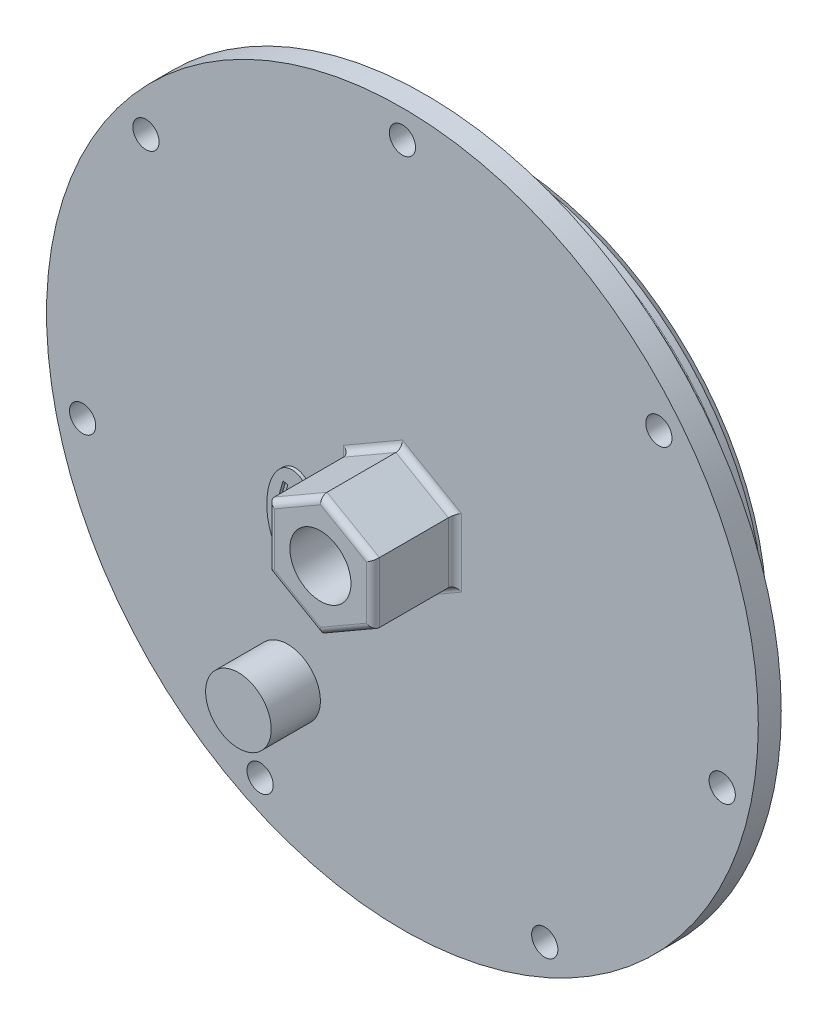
ISO-10303-21;
HEADER;
FILE_DESCRIPTION(('STEP AP214'),'2;1');
FILE_NAME('part.step','',(''),(''),'','','');
FILE_SCHEMA(('AUTOMOTIVE_DESIGN { 1 0 10303 214 1 1 1 1 }'));
ENDSEC;
DATA;
#1=APPLICATION_CONTEXT('core data for automotive mechanical design processes');
#2=APPLICATION_PROTOCOL_DEFINITION('international standard','automotive_design',2000,#1);
#3=PRODUCT_CONTEXT('',#1,'mechanical');
#4=PRODUCT('Part','Part','',(#3));
#5=PRODUCT_RELATED_PRODUCT_CATEGORY('part','',(#4));
#6=PRODUCT_DEFINITION_FORMATION('','',#4);
#7=PRODUCT_DEFINITION_CONTEXT('part definition',#1,'design');
#8=PRODUCT_DEFINITION('design','',#6,#7);
#9=PRODUCT_DEFINITION_SHAPE('','',#8);
#10=(LENGTH_UNIT() NAMED_UNIT(*) SI_UNIT(.MILLI.,.METRE.));
#11=(NAMED_UNIT(*) PLANE_ANGLE_UNIT() SI_UNIT($,.RADIAN.));
#12=(NAMED_UNIT(*) SI_UNIT($,.STERADIAN.) SOLID_ANGLE_UNIT());
#13=UNCERTAINTY_MEASURE_WITH_UNIT(LENGTH_MEASURE(1.E-05),#10,'distance_accuracy_value','');
#14=(GEOMETRIC_REPRESENTATION_CONTEXT(3) GLOBAL_UNCERTAINTY_ASSIGNED_CONTEXT((#13)) GLOBAL_UNIT_ASSIGNED_CONTEXT((#10,
#11,#12)) REPRESENTATION_CONTEXT('',''));
#15=CARTESIAN_POINT('',(0.,0.,0.));
#16=DIRECTION('',(0.,0.,1.));
#17=DIRECTION('',(1.,0.,0.));
#18=AXIS2_PLACEMENT_3D('',#15,#16,#17);
#19=CARTESIAN_POINT('',(0.,0.,30.));
#20=DIRECTION('',(0.,0.,1.));
#21=DIRECTION('',(1.,0.,0.));
#22=AXIS2_PLACEMENT_3D('',#19,#20,#21);
#23=PLANE('',#22);
#24=CARTESIAN_POINT('',(78.1831482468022,62.3489801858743,30.));
#25=DIRECTION('',(0.,0.,1.));
#26=DIRECTION('',(0.623489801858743,-0.781831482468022,0.));
#27=AXIS2_PLACEMENT_3D('',#24,#25,#26);
#28=CIRCLE('',#27,4.);
#29=CARTESIAN_POINT('',(80.6771074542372,59.2216542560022,30.));
#30=VERTEX_POINT('',#29);
#31=EDGE_CURVE('E988',#30,#30,#28,.T.);
#32=ORIENTED_EDGE('',*,*,#31,.F.);
#33=EDGE_LOOP('',(#32));
#34=FACE_BOUND('',#33,.T.);
#35=CARTESIAN_POINT('',(97.4927912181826,-22.2520933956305,30.));
#36=DIRECTION('',(0.,0.,1.));
#37=DIRECTION('',(-0.222520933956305,-0.974927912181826,0.));
#38=AXIS2_PLACEMENT_3D('',#35,#36,#37);
#39=CIRCLE('',#38,4.);
#40=CARTESIAN_POINT('',(96.6027074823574,-26.1518050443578,30.));
#41=VERTEX_POINT('',#40);
#42=EDGE_CURVE('E991',#41,#41,#39,.T.);
#43=ORIENTED_EDGE('',*,*,#42,.F.);
#44=EDGE_LOOP('',(#43));
#45=FACE_BOUND('',#44,.T.);
#46=CARTESIAN_POINT('',(43.3883739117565,-90.0968867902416,30.));
#47=DIRECTION('',(0.,0.,1.));
#48=DIRECTION('',(-0.900968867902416,-0.433883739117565,0.));
#49=AXIS2_PLACEMENT_3D('',#46,#47,#48);
#50=CIRCLE('',#49,4.);
#51=CARTESIAN_POINT('',(39.7844984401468,-91.8324217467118,30.));
#52=VERTEX_POINT('',#51);
#53=EDGE_CURVE('E997',#52,#52,#50,.T.);
#54=ORIENTED_EDGE('',*,*,#53,.F.);
#55=EDGE_LOOP('',(#54));
#56=FACE_BOUND('',#55,.T.);
#57=CARTESIAN_POINT('',(-43.3883739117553,-90.0968867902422,30.));
#58=DIRECTION('',(0.,0.,1.));
#59=DIRECTION('',(-0.900968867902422,0.433883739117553,0.));
#60=AXIS2_PLACEMENT_3D('',#57,#58,#59);
#61=CIRCLE('',#60,4.);
#62=CARTESIAN_POINT('',(-46.9922493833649,-88.361351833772,30.));
#63=VERTEX_POINT('',#62);
#64=EDGE_CURVE('E1001',#63,#63,#61,.T.);
#65=ORIENTED_EDGE('',*,*,#64,.F.);
#66=EDGE_LOOP('',(#65));
#67=FACE_BOUND('',#66,.T.);
#68=CARTESIAN_POINT('',(-97.4927912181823,-22.2520933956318,30.));
#69=DIRECTION('',(0.,0.,1.));
#70=DIRECTION('',(-0.222520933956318,0.974927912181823,0.));
#71=AXIS2_PLACEMENT_3D('',#68,#69,#70);
#72=CIRCLE('',#71,4.);
#73=CARTESIAN_POINT('',(-98.3828749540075,-18.3523817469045,30.));
#74=VERTEX_POINT('',#73);
#75=EDGE_CURVE('E1005',#74,#74,#72,.T.);
#76=ORIENTED_EDGE('',*,*,#75,.F.);
#77=EDGE_LOOP('',(#76));
#78=FACE_BOUND('',#77,.T.);
#79=CARTESIAN_POINT('',(-78.1831482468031,62.3489801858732,30.));
#80=DIRECTION('',(0.,0.,1.));
#81=DIRECTION('',(0.623489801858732,0.781831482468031,0.));
#82=AXIS2_PLACEMENT_3D('',#79,#80,#81);
#83=CIRCLE('',#82,4.);
#84=CARTESIAN_POINT('',(-75.6891890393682,65.4763061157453,30.));
#85=VERTEX_POINT('',#84);
#86=EDGE_CURVE('E1009',#85,#85,#83,.T.);
#87=ORIENTED_EDGE('',*,*,#86,.F.);
#88=EDGE_LOOP('',(#87));
#89=FACE_BOUND('',#88,.T.);
#90=CARTESIAN_POINT('',(0.,100.,30.));
#91=DIRECTION('',(0.,0.,1.));
#92=DIRECTION('',(1.,0.,0.));
#93=AXIS2_PLACEMENT_3D('',#90,#91,#92);
#94=CIRCLE('',#93,4.);
#95=CARTESIAN_POINT('',(4.,100.,30.));
#96=VERTEX_POINT('',#95);
#97=EDGE_CURVE('E1013',#96,#96,#94,.T.);
#98=ORIENTED_EDGE('',*,*,#97,.F.);
#99=EDGE_LOOP('',(#98));
#100=FACE_BOUND('',#99,.T.);
#101=CARTESIAN_POINT('',(-34.9999999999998,-60.6217782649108,30.));
#102=DIRECTION('',(0.,0.,1.));
#103=DIRECTION('',(1.,0.,0.));
#104=AXIS2_PLACEMENT_3D('',#101,#102,#103);
#105=CIRCLE('',#104,10.);
#106=CARTESIAN_POINT('',(-24.9999999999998,-60.6217782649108,30.));
#107=VERTEX_POINT('',#106);
#108=EDGE_CURVE('E1170',#107,#107,#105,.T.);
#109=ORIENTED_EDGE('',*,*,#108,.F.);
#110=EDGE_LOOP('',(#109));
#111=FACE_BOUND('',#110,.T.);
#112=CARTESIAN_POINT('',(0.,0.,30.));
#113=DIRECTION('',(0.,0.,1.));
#114=DIRECTION('',(1.,0.,0.));
#115=AXIS2_PLACEMENT_3D('',#112,#113,#114);
#116=CIRCLE('',#115,108.5);
#117=CARTESIAN_POINT('',(108.5,0.,30.));
#118=VERTEX_POINT('',#117);
#119=EDGE_CURVE('E1090',#118,#118,#116,.T.);
#120=ORIENTED_EDGE('',*,*,#119,.T.);
#121=EDGE_LOOP('',(#120));
#122=FACE_BOUND('',#121,.T.);
#123=DIRECTION('',(0.866025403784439,-0.5,0.));
#124=VECTOR('',#123,1.);
#125=CARTESIAN_POINT('',(-9.,-15.5884572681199,30.));
#126=LINE('',#125,#124);
#127=CARTESIAN_POINT('',(0.,-20.7846096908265,30.));
#128=VERTEX_POINT('',#127);
#129=CARTESIAN_POINT('',(-18.,-10.3923048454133,30.));
#130=VERTEX_POINT('',#129);
#131=EDGE_CURVE('E1147',#128,#130,#126,.F.);
#132=ORIENTED_EDGE('',*,*,#131,.T.);
#133=DIRECTION('',(0.,-1.,0.));
#134=VECTOR('',#133,1.);
#135=CARTESIAN_POINT('',(-18.,0.,30.));
#136=LINE('',#135,#134);
#137=CARTESIAN_POINT('',(-18.,10.3923048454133,30.));
#138=VERTEX_POINT('',#137);
#139=EDGE_CURVE('E1149',#130,#138,#136,.F.);
#140=ORIENTED_EDGE('',*,*,#139,.T.);
#141=DIRECTION('',(-0.866025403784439,-0.5,0.));
#142=VECTOR('',#141,1.);
#143=CARTESIAN_POINT('',(-9.,15.5884572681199,30.));
#144=LINE('',#143,#142);
#145=CARTESIAN_POINT('',(0.,20.7846096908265,30.));
#146=VERTEX_POINT('',#145);
#147=EDGE_CURVE('E1139',#138,#146,#144,.F.);
#148=ORIENTED_EDGE('',*,*,#147,.T.);
#149=DIRECTION('',(-0.866025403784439,0.5,0.));
#150=VECTOR('',#149,1.);
#151=CARTESIAN_POINT('',(9.,15.5884572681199,30.));
#152=LINE('',#151,#150);
#153=CARTESIAN_POINT('',(18.,10.3923048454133,30.));
#154=VERTEX_POINT('',#153);
#155=EDGE_CURVE('E1141',#146,#154,#152,.F.);
#156=ORIENTED_EDGE('',*,*,#155,.T.);
#157=DIRECTION('',(0.,1.,0.));
#158=VECTOR('',#157,1.);
#159=CARTESIAN_POINT('',(18.,0.,30.));
#160=LINE('',#159,#158);
#161=CARTESIAN_POINT('',(18.,-10.3923048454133,30.));
#162=VERTEX_POINT('',#161);
#163=EDGE_CURVE('E1143',#154,#162,#160,.F.);
#164=ORIENTED_EDGE('',*,*,#163,.T.);
#165=DIRECTION('',(0.866025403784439,0.5,0.));
#166=VECTOR('',#165,1.);
#167=CARTESIAN_POINT('',(9.,-15.5884572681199,30.));
#168=LINE('',#167,#166);
#169=EDGE_CURVE('E1145',#162,#128,#168,.F.);
#170=ORIENTED_EDGE('',*,*,#169,.T.);
#171=EDGE_LOOP('',(#132,#140,#148,#156,#164,#170));
#172=FACE_BOUND('',#171,.T.);
#173=CARTESIAN_POINT('',(-32.7437150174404,-15.7136643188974,29.9999999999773));
#174=DIRECTION('',(0.,0.,1.));
#175=DIRECTION('',(0.00915248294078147,0.999958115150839,0.));
#176=AXIS2_PLACEMENT_3D('',#173,#174,#175);
#177=ELLIPSE('',#176,12.8101888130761,7.60379428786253);
#178=CARTESIAN_POINT('',(-32.6264699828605,-2.90401205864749,29.9999999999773));
#179=VERTEX_POINT('',#178);
#180=EDGE_CURVE('E391',#179,#179,#177,.T.);
#181=ORIENTED_EDGE('',*,*,#180,.F.);
#182=EDGE_LOOP('',(#181));
#183=FACE_BOUND('',#182,.T.);
#184=ADVANCED_FACE('F40',(#34,#45,#56,#67,#78,#89,#100,#111,#122,#172,#183),#23,.T.);
#185=CARTESIAN_POINT('',(0.,0.,23.));
#186=DIRECTION('',(0.,0.,1.));
#187=DIRECTION('',(1.,0.,0.));
#188=AXIS2_PLACEMENT_3D('',#185,#186,#187);
#189=PLANE('',#188);
#190=CARTESIAN_POINT('',(78.1831482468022,62.3489801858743,23.));
#191=DIRECTION('',(0.,0.,1.));
#192=DIRECTION('',(1.,0.,0.));
#193=AXIS2_PLACEMENT_3D('',#190,#191,#192);
#194=CIRCLE('',#193,4.);
#195=CARTESIAN_POINT('',(82.1831482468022,62.3489801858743,23.));
#196=VERTEX_POINT('',#195);
#197=EDGE_CURVE('E44',#196,#196,#194,.T.);
#198=ORIENTED_EDGE('',*,*,#197,.T.);
#199=EDGE_LOOP('',(#198));
#200=FACE_BOUND('',#199,.T.);
#201=CARTESIAN_POINT('',(97.4927912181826,-22.2520933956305,23.));
#202=DIRECTION('',(0.,0.,1.));
#203=DIRECTION('',(1.,0.,0.));
#204=AXIS2_PLACEMENT_3D('',#201,#202,#203);
#205=CIRCLE('',#204,4.);
#206=CARTESIAN_POINT('',(101.492791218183,-22.2520933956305,23.));
#207=VERTEX_POINT('',#206);
#208=EDGE_CURVE('E993',#207,#207,#205,.T.);
#209=ORIENTED_EDGE('',*,*,#208,.T.);
#210=EDGE_LOOP('',(#209));
#211=FACE_BOUND('',#210,.T.);
#212=CARTESIAN_POINT('',(43.3883739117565,-90.0968867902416,23.));
#213=DIRECTION('',(0.,0.,1.));
#214=DIRECTION('',(1.,0.,0.));
#215=AXIS2_PLACEMENT_3D('',#212,#213,#214);
#216=CIRCLE('',#215,4.);
#217=CARTESIAN_POINT('',(47.3883739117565,-90.0968867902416,23.));
#218=VERTEX_POINT('',#217);
#219=EDGE_CURVE('E1000',#218,#218,#216,.T.);
#220=ORIENTED_EDGE('',*,*,#219,.T.);
#221=EDGE_LOOP('',(#220));
#222=FACE_BOUND('',#221,.T.);
#223=CARTESIAN_POINT('',(-43.3883739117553,-90.0968867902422,23.));
#224=DIRECTION('',(0.,0.,1.));
#225=DIRECTION('',(1.,0.,0.));
#226=AXIS2_PLACEMENT_3D('',#223,#224,#225);
#227=CIRCLE('',#226,4.);
#228=CARTESIAN_POINT('',(-39.3883739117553,-90.0968867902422,23.));
#229=VERTEX_POINT('',#228);
#230=EDGE_CURVE('E1004',#229,#229,#227,.T.);
#231=ORIENTED_EDGE('',*,*,#230,.T.);
#232=EDGE_LOOP('',(#231));
#233=FACE_BOUND('',#232,.T.);
#234=CARTESIAN_POINT('',(-97.4927912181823,-22.2520933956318,23.));
#235=DIRECTION('',(0.,0.,1.));
#236=DIRECTION('',(1.,0.,0.));
#237=AXIS2_PLACEMENT_3D('',#234,#235,#236);
#238=CIRCLE('',#237,4.);
#239=CARTESIAN_POINT('',(-93.4927912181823,-22.2520933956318,23.));
#240=VERTEX_POINT('',#239);
#241=EDGE_CURVE('E1008',#240,#240,#238,.T.);
#242=ORIENTED_EDGE('',*,*,#241,.T.);
#243=EDGE_LOOP('',(#242));
#244=FACE_BOUND('',#243,.T.);
#245=CARTESIAN_POINT('',(-78.1831482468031,62.3489801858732,23.));
#246=DIRECTION('',(0.,0.,1.));
#247=DIRECTION('',(1.,0.,0.));
#248=AXIS2_PLACEMENT_3D('',#245,#246,#247);
#249=CIRCLE('',#248,4.);
#250=CARTESIAN_POINT('',(-74.1831482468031,62.3489801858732,23.));
#251=VERTEX_POINT('',#250);
#252=EDGE_CURVE('E1012',#251,#251,#249,.T.);
#253=ORIENTED_EDGE('',*,*,#252,.T.);
#254=EDGE_LOOP('',(#253));
#255=FACE_BOUND('',#254,.T.);
#256=CARTESIAN_POINT('',(0.,100.,23.));
#257=DIRECTION('',(0.,0.,1.));
#258=DIRECTION('',(1.,0.,0.));
#259=AXIS2_PLACEMENT_3D('',#256,#257,#258);
#260=CIRCLE('',#259,4.);
#261=CARTESIAN_POINT('',(4.,100.,23.));
#262=VERTEX_POINT('',#261);
#263=EDGE_CURVE('E1016',#262,#262,#260,.T.);
#264=ORIENTED_EDGE('',*,*,#263,.T.);
#265=EDGE_LOOP('',(#264));
#266=FACE_BOUND('',#265,.T.);
#267=CARTESIAN_POINT('',(0.,0.,23.));
#268=DIRECTION('',(0.,0.,1.));
#269=DIRECTION('',(1.,0.,0.));
#270=AXIS2_PLACEMENT_3D('',#267,#268,#269);
#271=CIRCLE('',#270,108.5);
#272=CARTESIAN_POINT('',(108.5,0.,23.));
#273=VERTEX_POINT('',#272);
#274=EDGE_CURVE('E1081',#273,#273,#271,.T.);
#275=ORIENTED_EDGE('',*,*,#274,.F.);
#276=EDGE_LOOP('',(#275));
#277=FACE_BOUND('',#276,.T.);
#278=CARTESIAN_POINT('',(0.,0.,23.));
#279=DIRECTION('',(0.,0.,-1.));
#280=DIRECTION('',(-1.,0.,0.));
#281=AXIS2_PLACEMENT_3D('',#278,#279,#280);
#282=CIRCLE('',#281,82.);
#283=CARTESIAN_POINT('',(-82.,0.,23.));
#284=VERTEX_POINT('',#283);
#285=EDGE_CURVE('E1029',#284,#284,#282,.T.);
#286=ORIENTED_EDGE('',*,*,#285,.F.);
#287=EDGE_LOOP('',(#286));
#288=FACE_BOUND('',#287,.T.);
#289=ADVANCED_FACE('F454',(#200,#211,#222,#233,#244,#255,#266,#277,#288),#189,.F.);
#290=CARTESIAN_POINT('',(0.,0.,23.));
#291=DIRECTION('',(0.,0.,1.));
#292=DIRECTION('',(1.,0.,0.));
#293=AXIS2_PLACEMENT_3D('',#290,#291,#292);
#294=CYLINDRICAL_SURFACE('',#293,108.5);
#295=ORIENTED_EDGE('',*,*,#274,.T.);
#296=EDGE_LOOP('',(#295));
#297=FACE_BOUND('',#296,.T.);
#298=ORIENTED_EDGE('',*,*,#119,.F.);
#299=EDGE_LOOP('',(#298));
#300=FACE_BOUND('',#299,.T.);
#301=ADVANCED_FACE('F452',(#297,#300),#294,.T.);
#302=CARTESIAN_POINT('',(0.,18.475208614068,55.));
#303=DIRECTION('',(-0.5,-0.866025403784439,0.));
#304=DIRECTION('',(0.866025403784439,-0.5,0.));
#305=AXIS2_PLACEMENT_3D('',#302,#303,#304);
#306=PLANE('',#305);
#307=DIRECTION('',(0.,0.,-1.));
#308=VECTOR('',#307,1.);
#309=CARTESIAN_POINT('',(0.,18.475208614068,55.));
#310=LINE('',#309,#308);
#311=CARTESIAN_POINT('',(0.,18.475208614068,53.));
#312=VERTEX_POINT('',#311);
#313=CARTESIAN_POINT('',(0.,18.475208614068,32.));
#314=VERTEX_POINT('',#313);
#315=EDGE_CURVE('E1096',#312,#314,#310,.T.);
#316=ORIENTED_EDGE('',*,*,#315,.F.);
#317=DIRECTION('',(-0.866025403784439,0.5,0.));
#318=VECTOR('',#317,1.);
#319=CARTESIAN_POINT('',(0.,18.475208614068,53.));
#320=LINE('',#319,#318);
#321=CARTESIAN_POINT('',(16.,9.23760430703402,53.));
#322=VERTEX_POINT('',#321);
#323=EDGE_CURVE('E1137',#312,#322,#320,.F.);
#324=ORIENTED_EDGE('',*,*,#323,.T.);
#325=DIRECTION('',(0.,0.,-1.));
#326=VECTOR('',#325,1.);
#327=CARTESIAN_POINT('',(16.,9.23760430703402,55.));
#328=LINE('',#327,#326);
#329=CARTESIAN_POINT('',(16.,9.23760430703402,32.));
#330=VERTEX_POINT('',#329);
#331=EDGE_CURVE('E1378',#322,#330,#328,.T.);
#332=ORIENTED_EDGE('',*,*,#331,.T.);
#333=DIRECTION('',(-0.866025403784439,0.5,0.));
#334=VECTOR('',#333,1.);
#335=CARTESIAN_POINT('',(0.,18.475208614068,32.));
#336=LINE('',#335,#334);
#337=EDGE_CURVE('E1135',#330,#314,#336,.T.);
#338=ORIENTED_EDGE('',*,*,#337,.T.);
#339=EDGE_LOOP('',(#316,#324,#332,#338));
#340=FACE_BOUND('',#339,.T.);
#341=ADVANCED_FACE('F448',(#340),#306,.F.);
#342=CARTESIAN_POINT('',(0.,18.475208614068,55.));
#343=DIRECTION('',(0.5,-0.866025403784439,0.));
#344=DIRECTION('',(0.866025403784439,0.5,0.));
#345=AXIS2_PLACEMENT_3D('',#342,#343,#344);
#346=PLANE('',#345);
#347=DIRECTION('',(0.,0.,-1.));
#348=VECTOR('',#347,1.);
#349=CARTESIAN_POINT('',(-16.,9.23760430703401,55.));
#350=LINE('',#349,#348);
#351=CARTESIAN_POINT('',(-16.,9.23760430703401,53.));
#352=VERTEX_POINT('',#351);
#353=CARTESIAN_POINT('',(-16.,9.23760430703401,32.));
#354=VERTEX_POINT('',#353);
#355=EDGE_CURVE('E1363',#352,#354,#350,.T.);
#356=ORIENTED_EDGE('',*,*,#355,.F.);
#357=DIRECTION('',(-0.866025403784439,-0.5,0.));
#358=VECTOR('',#357,1.);
#359=CARTESIAN_POINT('',(0.,18.475208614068,53.));
#360=LINE('',#359,#358);
#361=EDGE_CURVE('E1133',#352,#312,#360,.F.);
#362=ORIENTED_EDGE('',*,*,#361,.T.);
#363=ORIENTED_EDGE('',*,*,#315,.T.);
#364=DIRECTION('',(-0.866025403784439,-0.5,0.));
#365=VECTOR('',#364,1.);
#366=CARTESIAN_POINT('',(0.,18.475208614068,32.));
#367=LINE('',#366,#365);
#368=EDGE_CURVE('E1131',#314,#354,#367,.T.);
#369=ORIENTED_EDGE('',*,*,#368,.T.);
#370=EDGE_LOOP('',(#356,#362,#363,#369));
#371=FACE_BOUND('',#370,.T.);
#372=ADVANCED_FACE('F444',(#371),#346,.F.);
#373=CARTESIAN_POINT('',(-16.,9.23760430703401,55.));
#374=DIRECTION('',(1.,0.,0.));
#375=DIRECTION('',(0.,1.,0.));
#376=AXIS2_PLACEMENT_3D('',#373,#374,#375);
#377=PLANE('',#376);
#378=DIRECTION('',(0.,0.,-1.));
#379=VECTOR('',#378,1.);
#380=CARTESIAN_POINT('',(-16.,-9.23760430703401,55.));
#381=LINE('',#380,#379);
#382=CARTESIAN_POINT('',(-16.,-9.23760430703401,53.));
#383=VERTEX_POINT('',#382);
#384=CARTESIAN_POINT('',(-16.,-9.23760430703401,32.));
#385=VERTEX_POINT('',#384);
#386=EDGE_CURVE('E1369',#383,#385,#381,.T.);
#387=ORIENTED_EDGE('',*,*,#386,.F.);
#388=DIRECTION('',(0.,-1.,0.));
#389=VECTOR('',#388,1.);
#390=CARTESIAN_POINT('',(-16.,9.23760430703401,53.));
#391=LINE('',#390,#389);
#392=EDGE_CURVE('E1129',#383,#352,#391,.F.);
#393=ORIENTED_EDGE('',*,*,#392,.T.);
#394=ORIENTED_EDGE('',*,*,#355,.T.);
#395=DIRECTION('',(0.,-1.,0.));
#396=VECTOR('',#395,1.);
#397=CARTESIAN_POINT('',(-16.,9.23760430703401,32.));
#398=LINE('',#397,#396);
#399=EDGE_CURVE('E1126',#354,#385,#398,.T.);
#400=ORIENTED_EDGE('',*,*,#399,.T.);
#401=EDGE_LOOP('',(#387,#393,#394,#400));
#402=FACE_BOUND('',#401,.T.);
#403=ADVANCED_FACE('F440',(#402),#377,.F.);
#404=CARTESIAN_POINT('',(-16.,-9.23760430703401,55.));
#405=DIRECTION('',(0.5,0.866025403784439,0.));
#406=DIRECTION('',(-0.866025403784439,0.5,0.));
#407=AXIS2_PLACEMENT_3D('',#404,#405,#406);
#408=PLANE('',#407);
#409=DIRECTION('',(0.,0.,-1.));
#410=VECTOR('',#409,1.);
#411=CARTESIAN_POINT('',(0.,-18.475208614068,55.));
#412=LINE('',#411,#410);
#413=CARTESIAN_POINT('',(0.,-18.475208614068,53.));
#414=VERTEX_POINT('',#413);
#415=CARTESIAN_POINT('',(0.,-18.475208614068,32.));
#416=VERTEX_POINT('',#415);
#417=EDGE_CURVE('E1370',#414,#416,#412,.T.);
#418=ORIENTED_EDGE('',*,*,#417,.F.);
#419=DIRECTION('',(0.866025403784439,-0.5,0.));
#420=VECTOR('',#419,1.);
#421=CARTESIAN_POINT('',(-16.,-9.23760430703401,53.));
#422=LINE('',#421,#420);
#423=EDGE_CURVE('E1124',#414,#383,#422,.F.);
#424=ORIENTED_EDGE('',*,*,#423,.T.);
#425=ORIENTED_EDGE('',*,*,#386,.T.);
#426=DIRECTION('',(0.866025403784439,-0.5,0.));
#427=VECTOR('',#426,1.);
#428=CARTESIAN_POINT('',(-16.,-9.23760430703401,32.));
#429=LINE('',#428,#427);
#430=EDGE_CURVE('E1122',#385,#416,#429,.T.);
#431=ORIENTED_EDGE('',*,*,#430,.T.);
#432=EDGE_LOOP('',(#418,#424,#425,#431));
#433=FACE_BOUND('',#432,.T.);
#434=ADVANCED_FACE('F436',(#433),#408,.F.);
#435=CARTESIAN_POINT('',(16.,-9.23760430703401,55.));
#436=DIRECTION('',(-0.5,0.866025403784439,0.));
#437=DIRECTION('',(-0.866025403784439,-0.5,0.));
#438=AXIS2_PLACEMENT_3D('',#435,#436,#437);
#439=PLANE('',#438);
#440=DIRECTION('',(0.,0.,-1.));
#441=VECTOR('',#440,1.);
#442=CARTESIAN_POINT('',(16.,-9.23760430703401,55.));
#443=LINE('',#442,#441);
#444=CARTESIAN_POINT('',(16.,-9.23760430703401,53.));
#445=VERTEX_POINT('',#444);
#446=CARTESIAN_POINT('',(16.,-9.23760430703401,32.));
#447=VERTEX_POINT('',#446);
#448=EDGE_CURVE('E1375',#445,#447,#443,.T.);
#449=ORIENTED_EDGE('',*,*,#448,.F.);
#450=DIRECTION('',(0.866025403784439,0.5,0.));
#451=VECTOR('',#450,1.);
#452=CARTESIAN_POINT('',(16.,-9.23760430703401,53.));
#453=LINE('',#452,#451);
#454=EDGE_CURVE('E1120',#445,#414,#453,.F.);
#455=ORIENTED_EDGE('',*,*,#454,.T.);
#456=ORIENTED_EDGE('',*,*,#417,.T.);
#457=DIRECTION('',(0.866025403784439,0.5,0.));
#458=VECTOR('',#457,1.);
#459=CARTESIAN_POINT('',(16.,-9.23760430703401,32.));
#460=LINE('',#459,#458);
#461=EDGE_CURVE('E1118',#416,#447,#460,.T.);
#462=ORIENTED_EDGE('',*,*,#461,.T.);
#463=EDGE_LOOP('',(#449,#455,#456,#462));
#464=FACE_BOUND('',#463,.T.);
#465=ADVANCED_FACE('F432',(#464),#439,.F.);
#466=CARTESIAN_POINT('',(16.,9.23760430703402,55.));
#467=DIRECTION('',(-1.,0.,0.));
#468=DIRECTION('',(0.,0.,1.));
#469=AXIS2_PLACEMENT_3D('',#466,#467,#468);
#470=PLANE('',#469);
#471=ORIENTED_EDGE('',*,*,#331,.F.);
#472=DIRECTION('',(0.,1.,0.));
#473=VECTOR('',#472,1.);
#474=CARTESIAN_POINT('',(16.,9.23760430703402,53.));
#475=LINE('',#474,#473);
#476=EDGE_CURVE('E1115',#322,#445,#475,.F.);
#477=ORIENTED_EDGE('',*,*,#476,.T.);
#478=ORIENTED_EDGE('',*,*,#448,.T.);
#479=DIRECTION('',(0.,1.,0.));
#480=VECTOR('',#479,1.);
#481=CARTESIAN_POINT('',(16.,9.23760430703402,32.));
#482=LINE('',#481,#480);
#483=EDGE_CURVE('E1113',#447,#330,#482,.T.);
#484=ORIENTED_EDGE('',*,*,#483,.T.);
#485=EDGE_LOOP('',(#471,#477,#478,#484));
#486=FACE_BOUND('',#485,.T.);
#487=ADVANCED_FACE('F428',(#486),#470,.F.);
#488=CARTESIAN_POINT('',(16.,9.23760430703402,55.));
#489=DIRECTION('',(0.,0.,-1.));
#490=DIRECTION('',(-1.,0.,0.));
#491=AXIS2_PLACEMENT_3D('',#488,#489,#490);
#492=PLANE('',#491);
#493=CARTESIAN_POINT('',(0.,0.,55.));
#494=DIRECTION('',(0.,0.,1.));
#495=DIRECTION('',(1.,0.,0.));
#496=AXIS2_PLACEMENT_3D('',#493,#494,#495);
#497=CIRCLE('',#496,9.315);
#498=CARTESIAN_POINT('',(9.315,0.,55.));
#499=VERTEX_POINT('',#498);
#500=EDGE_CURVE('E1017',#499,#499,#497,.T.);
#501=ORIENTED_EDGE('',*,*,#500,.F.);
#502=EDGE_LOOP('',(#501));
#503=FACE_BOUND('',#502,.T.);
#504=DIRECTION('',(0.866025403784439,0.5,0.));
#505=VECTOR('',#504,1.);
#506=CARTESIAN_POINT('',(23.,-2.88675134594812,55.));
#507=LINE('',#506,#505);
#508=CARTESIAN_POINT('',(0.,-16.1658075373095,55.));
#509=VERTEX_POINT('',#508);
#510=CARTESIAN_POINT('',(14.,-8.08290376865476,55.));
#511=VERTEX_POINT('',#510);
#512=EDGE_CURVE('E1108',#509,#511,#507,.T.);
#513=ORIENTED_EDGE('',*,*,#512,.T.);
#514=DIRECTION('',(0.,1.,0.));
#515=VECTOR('',#514,1.);
#516=CARTESIAN_POINT('',(14.,9.23760430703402,55.));
#517=LINE('',#516,#515);
#518=CARTESIAN_POINT('',(14.,8.08290376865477,55.));
#519=VERTEX_POINT('',#518);
#520=EDGE_CURVE('E1110',#511,#519,#517,.T.);
#521=ORIENTED_EDGE('',*,*,#520,.T.);
#522=DIRECTION('',(-0.866025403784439,0.5,0.));
#523=VECTOR('',#522,1.);
#524=CARTESIAN_POINT('',(15.,7.50555349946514,55.));
#525=LINE('',#524,#523);
#526=CARTESIAN_POINT('',(0.,16.1658075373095,55.));
#527=VERTEX_POINT('',#526);
#528=EDGE_CURVE('E1093',#519,#527,#525,.T.);
#529=ORIENTED_EDGE('',*,*,#528,.T.);
#530=DIRECTION('',(-0.866025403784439,-0.5,0.));
#531=VECTOR('',#530,1.);
#532=CARTESIAN_POINT('',(9.00000000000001,21.3619599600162,55.));
#533=LINE('',#532,#531);
#534=CARTESIAN_POINT('',(-14.,8.08290376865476,55.));
#535=VERTEX_POINT('',#534);
#536=EDGE_CURVE('E1102',#527,#535,#533,.T.);
#537=ORIENTED_EDGE('',*,*,#536,.T.);
#538=DIRECTION('',(0.,-1.,0.));
#539=VECTOR('',#538,1.);
#540=CARTESIAN_POINT('',(-14.,9.23760430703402,55.));
#541=LINE('',#540,#539);
#542=CARTESIAN_POINT('',(-14.,-8.08290376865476,55.));
#543=VERTEX_POINT('',#542);
#544=EDGE_CURVE('E1104',#535,#543,#541,.T.);
#545=ORIENTED_EDGE('',*,*,#544,.T.);
#546=DIRECTION('',(0.866025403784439,-0.5,0.));
#547=VECTOR('',#546,1.);
#548=CARTESIAN_POINT('',(0.99999999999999,-16.7431578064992,55.));
#549=LINE('',#548,#547);
#550=EDGE_CURVE('E1106',#543,#509,#549,.T.);
#551=ORIENTED_EDGE('',*,*,#550,.T.);
#552=EDGE_LOOP('',(#513,#521,#529,#537,#545,#551));
#553=FACE_BOUND('',#552,.T.);
#554=ADVANCED_FACE('F414',(#503,#553),#492,.F.);
#555=CARTESIAN_POINT('',(-34.9999999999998,-60.6217782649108,45.));
#556=DIRECTION('',(0.,0.,-1.));
#557=DIRECTION('',(-1.,0.,0.));
#558=AXIS2_PLACEMENT_3D('',#555,#556,#557);
#559=CYLINDRICAL_SURFACE('',#558,10.);
#560=CARTESIAN_POINT('',(-34.9999999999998,-60.6217782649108,45.));
#561=DIRECTION('',(0.,0.,1.));
#562=DIRECTION('',(1.,0.,0.));
#563=AXIS2_PLACEMENT_3D('',#560,#561,#562);
#564=CIRCLE('',#563,10.);
#565=CARTESIAN_POINT('',(-24.9999999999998,-60.6217782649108,45.));
#566=VERTEX_POINT('',#565);
#567=EDGE_CURVE('E1381',#566,#566,#564,.T.);
#568=ORIENTED_EDGE('',*,*,#567,.F.);
#569=EDGE_LOOP('',(#568));
#570=FACE_BOUND('',#569,.T.);
#571=ORIENTED_EDGE('',*,*,#108,.T.);
#572=EDGE_LOOP('',(#571));
#573=FACE_BOUND('',#572,.T.);
#574=ADVANCED_FACE('F410',(#570,#573),#559,.T.);
#575=CARTESIAN_POINT('',(-34.9999999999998,-60.6217782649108,45.));
#576=DIRECTION('',(0.,0.,1.));
#577=DIRECTION('',(1.,0.,0.));
#578=AXIS2_PLACEMENT_3D('',#575,#576,#577);
#579=PLANE('',#578);
#580=ORIENTED_EDGE('',*,*,#567,.T.);
#581=EDGE_LOOP('',(#580));
#582=FACE_BOUND('',#581,.T.);
#583=ADVANCED_FACE('F406',(#582),#579,.T.);
#584=CARTESIAN_POINT('',(-14.,9.23760430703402,53.));
#585=DIRECTION('',(0.,-1.,0.));
#586=DIRECTION('',(1.,0.,0.));
#587=AXIS2_PLACEMENT_3D('',#584,#585,#586);
#588=CYLINDRICAL_SURFACE('',#587,2.);
#589=CARTESIAN_POINT('',(-14.,8.08290376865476,53.));
#590=DIRECTION('',(-0.5,-0.866025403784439,0.));
#591=DIRECTION('',(-0.866025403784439,0.5,0.));
#592=AXIS2_PLACEMENT_3D('',#589,#590,#591);
#593=ELLIPSE('',#592,2.3094010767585,2.);
#594=EDGE_CURVE('E1164',#352,#535,#593,.F.);
#595=ORIENTED_EDGE('',*,*,#594,.F.);
#596=ORIENTED_EDGE('',*,*,#392,.F.);
#597=CARTESIAN_POINT('',(-14.,-8.08290376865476,53.));
#598=DIRECTION('',(0.5,-0.866025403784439,0.));
#599=DIRECTION('',(-0.866025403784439,-0.5,0.));
#600=AXIS2_PLACEMENT_3D('',#597,#598,#599);
#601=ELLIPSE('',#600,2.3094010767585,2.);
#602=EDGE_CURVE('E1167',#543,#383,#601,.T.);
#603=ORIENTED_EDGE('',*,*,#602,.F.);
#604=ORIENTED_EDGE('',*,*,#544,.F.);
#605=EDGE_LOOP('',(#595,#596,#603,#604));
#606=FACE_BOUND('',#605,.T.);
#607=ADVANCED_FACE('F409',(#606),#588,.T.);
#608=CARTESIAN_POINT('',(0.999999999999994,-16.7431578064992,53.));
#609=DIRECTION('',(0.866025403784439,-0.5,0.));
#610=DIRECTION('',(0.5,0.866025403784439,0.));
#611=AXIS2_PLACEMENT_3D('',#608,#609,#610);
#612=CYLINDRICAL_SURFACE('',#611,2.);
#613=ORIENTED_EDGE('',*,*,#602,.T.);
#614=ORIENTED_EDGE('',*,*,#423,.F.);
#615=CARTESIAN_POINT('',(0.,-16.1658075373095,53.));
#616=DIRECTION('',(1.,0.,0.));
#617=DIRECTION('',(0.,-1.,0.));
#618=AXIS2_PLACEMENT_3D('',#615,#616,#617);
#619=ELLIPSE('',#618,2.3094010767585,2.);
#620=EDGE_CURVE('E1161',#509,#414,#619,.T.);
#621=ORIENTED_EDGE('',*,*,#620,.F.);
#622=ORIENTED_EDGE('',*,*,#550,.F.);
#623=EDGE_LOOP('',(#613,#614,#621,#622));
#624=FACE_BOUND('',#623,.T.);
#625=ADVANCED_FACE('F492',(#624),#612,.T.);
#626=CARTESIAN_POINT('',(9.00000000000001,21.3619599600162,53.));
#627=DIRECTION('',(-0.866025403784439,-0.5,0.));
#628=DIRECTION('',(0.5,-0.866025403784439,0.));
#629=AXIS2_PLACEMENT_3D('',#626,#627,#628);
#630=CYLINDRICAL_SURFACE('',#629,2.);
#631=ORIENTED_EDGE('',*,*,#594,.T.);
#632=ORIENTED_EDGE('',*,*,#536,.F.);
#633=CARTESIAN_POINT('',(0.,16.1658075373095,53.));
#634=DIRECTION('',(-1.,0.,0.));
#635=DIRECTION('',(0.,1.,0.));
#636=AXIS2_PLACEMENT_3D('',#633,#634,#635);
#637=ELLIPSE('',#636,2.3094010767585,2.);
#638=EDGE_CURVE('E1158',#312,#527,#637,.F.);
#639=ORIENTED_EDGE('',*,*,#638,.F.);
#640=ORIENTED_EDGE('',*,*,#361,.F.);
#641=EDGE_LOOP('',(#631,#632,#639,#640));
#642=FACE_BOUND('',#641,.T.);
#643=ADVANCED_FACE('F488',(#642),#630,.T.);
#644=CARTESIAN_POINT('',(23.,-2.88675134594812,53.));
#645=DIRECTION('',(0.866025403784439,0.5,0.));
#646=DIRECTION('',(-0.5,0.866025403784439,0.));
#647=AXIS2_PLACEMENT_3D('',#644,#645,#646);
#648=CYLINDRICAL_SURFACE('',#647,2.);
#649=ORIENTED_EDGE('',*,*,#620,.T.);
#650=ORIENTED_EDGE('',*,*,#454,.F.);
#651=CARTESIAN_POINT('',(14.,-8.08290376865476,53.));
#652=DIRECTION('',(0.5,0.866025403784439,0.));
#653=DIRECTION('',(0.866025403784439,-0.5,0.));
#654=AXIS2_PLACEMENT_3D('',#651,#652,#653);
#655=ELLIPSE('',#654,2.3094010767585,2.);
#656=EDGE_CURVE('E1155',#511,#445,#655,.T.);
#657=ORIENTED_EDGE('',*,*,#656,.F.);
#658=ORIENTED_EDGE('',*,*,#512,.F.);
#659=EDGE_LOOP('',(#649,#650,#657,#658));
#660=FACE_BOUND('',#659,.T.);
#661=ADVANCED_FACE('F484',(#660),#648,.T.);
#662=CARTESIAN_POINT('',(15.,7.50555349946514,53.));
#663=DIRECTION('',(-0.866025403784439,0.5,0.));
#664=DIRECTION('',(-0.5,-0.866025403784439,0.));
#665=AXIS2_PLACEMENT_3D('',#662,#663,#664);
#666=CYLINDRICAL_SURFACE('',#665,2.);
#667=ORIENTED_EDGE('',*,*,#638,.T.);
#668=ORIENTED_EDGE('',*,*,#528,.F.);
#669=CARTESIAN_POINT('',(14.,8.08290376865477,53.));
#670=DIRECTION('',(-0.5,0.866025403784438,0.));
#671=DIRECTION('',(-0.866025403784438,-0.5,0.));
#672=AXIS2_PLACEMENT_3D('',#669,#670,#671);
#673=ELLIPSE('',#672,2.3094010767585,2.);
#674=EDGE_CURVE('E1153',#322,#519,#673,.F.);
#675=ORIENTED_EDGE('',*,*,#674,.F.);
#676=ORIENTED_EDGE('',*,*,#323,.F.);
#677=EDGE_LOOP('',(#667,#668,#675,#676));
#678=FACE_BOUND('',#677,.T.);
#679=ADVANCED_FACE('F480',(#678),#666,.T.);
#680=CARTESIAN_POINT('',(14.,9.23760430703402,53.));
#681=DIRECTION('',(0.,1.,0.));
#682=DIRECTION('',(0.,0.,1.));
#683=AXIS2_PLACEMENT_3D('',#680,#681,#682);
#684=CYLINDRICAL_SURFACE('',#683,2.);
#685=ORIENTED_EDGE('',*,*,#656,.T.);
#686=ORIENTED_EDGE('',*,*,#476,.F.);
#687=ORIENTED_EDGE('',*,*,#674,.T.);
#688=ORIENTED_EDGE('',*,*,#520,.F.);
#689=EDGE_LOOP('',(#685,#686,#687,#688));
#690=FACE_BOUND('',#689,.T.);
#691=ADVANCED_FACE('F476',(#690),#684,.T.);
#692=CARTESIAN_POINT('',(18.,9.23760430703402,32.));
#693=DIRECTION('',(0.,1.,0.));
#694=DIRECTION('',(0.,0.,1.));
#695=AXIS2_PLACEMENT_3D('',#692,#693,#694);
#696=CYLINDRICAL_SURFACE('',#695,2.);
#697=CARTESIAN_POINT('',(18.,-10.3923048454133,32.));
#698=DIRECTION('',(0.5,0.866025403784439,0.));
#699=DIRECTION('',(-0.866025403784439,0.5,0.));
#700=AXIS2_PLACEMENT_3D('',#697,#698,#699);
#701=ELLIPSE('',#700,2.3094010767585,2.);
#702=EDGE_CURVE('E1180',#162,#447,#701,.T.);
#703=ORIENTED_EDGE('',*,*,#702,.F.);
#704=ORIENTED_EDGE('',*,*,#163,.F.);
#705=CARTESIAN_POINT('',(18.,10.3923048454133,32.));
#706=DIRECTION('',(-0.5,0.866025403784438,0.));
#707=DIRECTION('',(-0.866025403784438,-0.5,0.));
#708=AXIS2_PLACEMENT_3D('',#705,#706,#707);
#709=ELLIPSE('',#708,2.3094010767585,2.);
#710=EDGE_CURVE('E1156',#330,#154,#709,.F.);
#711=ORIENTED_EDGE('',*,*,#710,.F.);
#712=ORIENTED_EDGE('',*,*,#483,.F.);
#713=EDGE_LOOP('',(#703,#704,#711,#712));
#714=FACE_BOUND('',#713,.T.);
#715=ADVANCED_FACE('F479',(#714),#696,.F.);
#716=CARTESIAN_POINT('',(1.,20.2072594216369,32.));
#717=DIRECTION('',(-0.866025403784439,0.5,0.));
#718=DIRECTION('',(-0.5,-0.866025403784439,0.));
#719=AXIS2_PLACEMENT_3D('',#716,#717,#718);
#720=CYLINDRICAL_SURFACE('',#719,2.);
#721=ORIENTED_EDGE('',*,*,#710,.T.);
#722=ORIENTED_EDGE('',*,*,#155,.F.);
#723=CARTESIAN_POINT('',(0.,20.7846096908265,32.));
#724=DIRECTION('',(-1.,0.,0.));
#725=DIRECTION('',(0.,-1.,0.));
#726=AXIS2_PLACEMENT_3D('',#723,#724,#725);
#727=ELLIPSE('',#726,2.3094010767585,2.);
#728=EDGE_CURVE('E1177',#314,#146,#727,.F.);
#729=ORIENTED_EDGE('',*,*,#728,.F.);
#730=ORIENTED_EDGE('',*,*,#337,.F.);
#731=EDGE_LOOP('',(#721,#722,#729,#730));
#732=FACE_BOUND('',#731,.T.);
#733=ADVANCED_FACE('F515',(#732),#720,.F.);
#734=CARTESIAN_POINT('',(17.,-10.9696551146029,32.));
#735=DIRECTION('',(0.866025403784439,0.5,0.));
#736=DIRECTION('',(-0.5,0.866025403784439,0.));
#737=AXIS2_PLACEMENT_3D('',#734,#735,#736);
#738=CYLINDRICAL_SURFACE('',#737,2.);
#739=ORIENTED_EDGE('',*,*,#702,.T.);
#740=ORIENTED_EDGE('',*,*,#461,.F.);
#741=CARTESIAN_POINT('',(0.,-20.7846096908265,32.));
#742=DIRECTION('',(1.,0.,0.));
#743=DIRECTION('',(0.,1.,0.));
#744=AXIS2_PLACEMENT_3D('',#741,#742,#743);
#745=ELLIPSE('',#744,2.3094010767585,2.);
#746=EDGE_CURVE('E1174',#128,#416,#745,.T.);
#747=ORIENTED_EDGE('',*,*,#746,.F.);
#748=ORIENTED_EDGE('',*,*,#169,.F.);
#749=EDGE_LOOP('',(#739,#740,#747,#748));
#750=FACE_BOUND('',#749,.T.);
#751=ADVANCED_FACE('F511',(#750),#738,.F.);
#752=CARTESIAN_POINT('',(-0.999999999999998,20.2072594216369,32.));
#753=DIRECTION('',(-0.866025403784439,-0.5,0.));
#754=DIRECTION('',(0.5,-0.866025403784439,0.));
#755=AXIS2_PLACEMENT_3D('',#752,#753,#754);
#756=CYLINDRICAL_SURFACE('',#755,2.);
#757=ORIENTED_EDGE('',*,*,#728,.T.);
#758=ORIENTED_EDGE('',*,*,#147,.F.);
#759=CARTESIAN_POINT('',(-18.,10.3923048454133,32.));
#760=DIRECTION('',(-0.5,-0.866025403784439,0.));
#761=DIRECTION('',(-0.866025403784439,0.5,0.));
#762=AXIS2_PLACEMENT_3D('',#759,#760,#761);
#763=ELLIPSE('',#762,2.3094010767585,2.);
#764=EDGE_CURVE('E1172',#354,#138,#763,.F.);
#765=ORIENTED_EDGE('',*,*,#764,.F.);
#766=ORIENTED_EDGE('',*,*,#368,.F.);
#767=EDGE_LOOP('',(#757,#758,#765,#766));
#768=FACE_BOUND('',#767,.T.);
#769=ADVANCED_FACE('F507',(#768),#756,.F.);
#770=CARTESIAN_POINT('',(-17.,-10.9696551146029,32.));
#771=DIRECTION('',(0.866025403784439,-0.5,0.));
#772=DIRECTION('',(0.5,0.866025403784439,0.));
#773=AXIS2_PLACEMENT_3D('',#770,#771,#772);
#774=CYLINDRICAL_SURFACE('',#773,2.);
#775=ORIENTED_EDGE('',*,*,#746,.T.);
#776=ORIENTED_EDGE('',*,*,#430,.F.);
#777=CARTESIAN_POINT('',(-18.,-10.3923048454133,32.));
#778=DIRECTION('',(0.5,-0.866025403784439,0.));
#779=DIRECTION('',(0.866025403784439,0.5,0.));
#780=AXIS2_PLACEMENT_3D('',#777,#778,#779);
#781=ELLIPSE('',#780,2.3094010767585,2.);
#782=EDGE_CURVE('E396',#130,#385,#781,.T.);
#783=ORIENTED_EDGE('',*,*,#782,.F.);
#784=ORIENTED_EDGE('',*,*,#131,.F.);
#785=EDGE_LOOP('',(#775,#776,#783,#784));
#786=FACE_BOUND('',#785,.T.);
#787=ADVANCED_FACE('F503',(#786),#774,.F.);
#788=CARTESIAN_POINT('',(-18.,9.23760430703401,32.));
#789=DIRECTION('',(0.,-1.,0.));
#790=DIRECTION('',(1.,0.,0.));
#791=AXIS2_PLACEMENT_3D('',#788,#789,#790);
#792=CYLINDRICAL_SURFACE('',#791,2.);
#793=ORIENTED_EDGE('',*,*,#764,.T.);
#794=ORIENTED_EDGE('',*,*,#139,.F.);
#795=ORIENTED_EDGE('',*,*,#782,.T.);
#796=ORIENTED_EDGE('',*,*,#399,.F.);
#797=EDGE_LOOP('',(#793,#794,#795,#796));
#798=FACE_BOUND('',#797,.T.);
#799=ADVANCED_FACE('F500',(#798),#792,.F.);
#800=CARTESIAN_POINT('',(-32.7437150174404,-15.7136643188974,30.9999999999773));
#801=DIRECTION('',(0.,0.,1.));
#802=DIRECTION('',(1.,0.,0.));
#803=AXIS2_PLACEMENT_3D('',#800,#801,#802);
#804=PLANE('',#803);
#805=DIRECTION('',(-0.272280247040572,-0.962217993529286,0.));
#806=VECTOR('',#805,1.);
#807=CARTESIAN_POINT('',(-33.4378618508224,-12.6576974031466,30.9999999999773));
#808=LINE('',#807,#806);
#809=CARTESIAN_POINT('',(-32.4508459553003,-9.16965717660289,30.9999999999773));
#810=VERTEX_POINT('',#809);
#811=CARTESIAN_POINT('',(-33.4378618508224,-12.6576974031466,30.9999999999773));
#812=VERTEX_POINT('',#811);
#813=EDGE_CURVE('E325',#810,#812,#808,.T.);
#814=ORIENTED_EDGE('',*,*,#813,.F.);
#815=DIRECTION('',(-0.962217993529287,0.27228024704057,0.));
#816=VECTOR('',#815,1.);
#817=CARTESIAN_POINT('',(-32.4508459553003,-9.16965717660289,30.9999999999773));
#818=LINE('',#817,#816);
#819=CARTESIAN_POINT('',(-31.0075189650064,-9.57807754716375,30.9999999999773));
#820=VERTEX_POINT('',#819);
#821=EDGE_CURVE('E323',#820,#810,#818,.T.);
#822=ORIENTED_EDGE('',*,*,#821,.F.);
#823=DIRECTION('',(0.272280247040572,0.962217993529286,0.));
#824=VECTOR('',#823,1.);
#825=CARTESIAN_POINT('',(-31.9945348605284,-13.0661177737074,30.9999999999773));
#826=LINE('',#825,#824);
#827=CARTESIAN_POINT('',(-31.9945348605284,-13.0661177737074,30.9999999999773));
#828=VERTEX_POINT('',#827);
#829=EDGE_CURVE('E343',#828,#820,#826,.T.);
#830=ORIENTED_EDGE('',*,*,#829,.F.);
#831=DIRECTION('',(-0.962217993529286,0.272280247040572,0.));
#832=VECTOR('',#831,1.);
#833=CARTESIAN_POINT('',(-31.9945348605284,-13.0661177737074,30.9999999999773));
#834=LINE('',#833,#832);
#835=CARTESIAN_POINT('',(-28.3862173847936,-14.0871687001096,30.9999999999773));
#836=VERTEX_POINT('',#835);
#837=EDGE_CURVE('E340',#836,#828,#834,.T.);
#838=ORIENTED_EDGE('',*,*,#837,.F.);
#839=DIRECTION('',(0.272280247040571,0.962217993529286,0.));
#840=VECTOR('',#839,1.);
#841=CARTESIAN_POINT('',(-28.7946377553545,-15.5304956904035,30.9999999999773));
#842=LINE('',#841,#840);
#843=CARTESIAN_POINT('',(-28.7946377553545,-15.5304956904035,30.9999999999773));
#844=VERTEX_POINT('',#843);
#845=EDGE_CURVE('E338',#844,#836,#842,.T.);
#846=ORIENTED_EDGE('',*,*,#845,.F.);
#847=DIRECTION('',(0.962217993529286,-0.272280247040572,0.));
#848=VECTOR('',#847,1.);
#849=CARTESIAN_POINT('',(-28.7946377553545,-15.5304956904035,30.9999999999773));
#850=LINE('',#849,#848);
#851=CARTESIAN_POINT('',(-37.0937679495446,-13.1820785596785,30.9999999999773));
#852=VERTEX_POINT('',#851);
#853=EDGE_CURVE('E336',#852,#844,#850,.T.);
#854=ORIENTED_EDGE('',*,*,#853,.F.);
#855=DIRECTION('',(-0.272280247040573,-0.962217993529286,0.));
#856=VECTOR('',#855,1.);
#857=CARTESIAN_POINT('',(-37.0937679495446,-13.1820785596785,30.9999999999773));
#858=LINE('',#857,#856);
#859=CARTESIAN_POINT('',(-35.392016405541,-7.16821610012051,30.9999999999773));
#860=VERTEX_POINT('',#859);
#861=EDGE_CURVE('E334',#860,#852,#858,.T.);
#862=ORIENTED_EDGE('',*,*,#861,.F.);
#863=DIRECTION('',(-0.962217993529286,0.272280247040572,0.));
#864=VECTOR('',#863,1.);
#865=CARTESIAN_POINT('',(-33.9486894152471,-7.57663647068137,30.9999999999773));
#866=LINE('',#865,#864);
#867=CARTESIAN_POINT('',(-33.9486894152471,-7.57663647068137,30.9999999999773));
#868=VERTEX_POINT('',#867);
#869=EDGE_CURVE('E332',#868,#860,#866,.T.);
#870=ORIENTED_EDGE('',*,*,#869,.F.);
#871=DIRECTION('',(0.272280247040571,0.962217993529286,0.));
#872=VECTOR('',#871,1.);
#873=CARTESIAN_POINT('',(-33.9486894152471,-7.57663647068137,30.9999999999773));
#874=LINE('',#873,#872);
#875=CARTESIAN_POINT('',(-35.2420205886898,-12.1471719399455,30.9999999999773));
#876=VERTEX_POINT('',#875);
#877=EDGE_CURVE('E330',#876,#868,#874,.T.);
#878=ORIENTED_EDGE('',*,*,#877,.F.);
#879=DIRECTION('',(-0.962217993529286,0.272280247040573,0.));
#880=VECTOR('',#879,1.);
#881=CARTESIAN_POINT('',(-35.2420205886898,-12.1471719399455,30.9999999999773));
#882=LINE('',#881,#880);
#883=EDGE_CURVE('E328',#812,#876,#882,.T.);
#884=ORIENTED_EDGE('',*,*,#883,.F.);
#885=EDGE_LOOP('',(#814,#822,#830,#838,#846,#854,#862,#870,#878,#884));
#886=FACE_BOUND('',#885,.T.);
#887=CARTESIAN_POINT('',(-32.7437150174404,-15.7136643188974,30.9999999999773));
#888=DIRECTION('',(0.,0.,1.));
#889=DIRECTION('',(0.00915248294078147,0.999958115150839,0.));
#890=AXIS2_PLACEMENT_3D('',#887,#888,#889);
#891=ELLIPSE('',#890,12.8101888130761,7.60379428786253);
#892=CARTESIAN_POINT('',(-32.6264699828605,-2.90401205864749,30.9999999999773));
#893=VERTEX_POINT('',#892);
#894=EDGE_CURVE('E392',#893,#893,#891,.T.);
#895=ORIENTED_EDGE('',*,*,#894,.T.);
#896=EDGE_LOOP('',(#895));
#897=FACE_BOUND('',#896,.T.);
#898=DIRECTION('',(0.107999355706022,-0.994150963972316,0.));
#899=VECTOR('',#898,1.);
#900=CARTESIAN_POINT('',(-37.7293222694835,-17.660727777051,30.9999999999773));
#901=LINE('',#900,#899);
#902=CARTESIAN_POINT('',(-37.7293222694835,-17.660727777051,30.9999999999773));
#903=VERTEX_POINT('',#902);
#904=CARTESIAN_POINT('',(-37.5673232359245,-19.1519542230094,30.9999999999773));
#905=VERTEX_POINT('',#904);
#906=EDGE_CURVE('E254',#903,#905,#901,.T.);
#907=ORIENTED_EDGE('',*,*,#906,.F.);
#908=DIRECTION('',(-0.994150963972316,-0.107999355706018,0.));
#909=VECTOR('',#908,1.);
#910=CARTESIAN_POINT('',(-37.7293222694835,-17.660727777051,30.9999999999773));
#911=LINE('',#910,#909);
#912=CARTESIAN_POINT('',(-29.1547702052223,-16.7292333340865,30.9999999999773));
#913=VERTEX_POINT('',#912);
#914=EDGE_CURVE('E244',#913,#903,#911,.T.);
#915=ORIENTED_EDGE('',*,*,#914,.F.);
#916=DIRECTION('',(-0.107999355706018,0.994150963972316,0.));
#917=VECTOR('',#916,1.);
#918=CARTESIAN_POINT('',(-29.1547702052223,-16.7292333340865,30.9999999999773));
#919=LINE('',#918,#917);
#920=CARTESIAN_POINT('',(-28.9097425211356,-18.9847514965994,30.9999999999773));
#921=VERTEX_POINT('',#920);
#922=EDGE_CURVE('E284',#921,#913,#919,.T.);
#923=ORIENTED_EDGE('',*,*,#922,.F.);
#924=DIRECTION('',(0.7439921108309,0.668188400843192,0.));
#925=VECTOR('',#924,1.);
#926=CARTESIAN_POINT('',(-32.5488787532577,-22.2531041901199,30.9999999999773));
#927=LINE('',#926,#925);
#928=CARTESIAN_POINT('',(-32.5488787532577,-22.2531041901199,30.9999999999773));
#929=VERTEX_POINT('',#928);
#930=EDGE_CURVE('E281',#929,#921,#927,.T.);
#931=ORIENTED_EDGE('',*,*,#930,.F.);
#932=DIRECTION('',(-0.994150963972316,-0.107999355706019,0.));
#933=VECTOR('',#932,1.);
#934=CARTESIAN_POINT('',(-28.6012735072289,-21.8242570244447,30.9999999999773));
#935=LINE('',#934,#933);
#936=CARTESIAN_POINT('',(-28.6012735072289,-21.8242570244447,30.9999999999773));
#937=VERTEX_POINT('',#936);
#938=EDGE_CURVE('E279',#937,#929,#935,.T.);
#939=ORIENTED_EDGE('',*,*,#938,.F.);
#940=DIRECTION('',(-0.107999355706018,0.994150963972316,0.));
#941=VECTOR('',#940,1.);
#942=CARTESIAN_POINT('',(-28.4392744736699,-23.3154834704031,30.9999999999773));
#943=LINE('',#942,#941);
#944=CARTESIAN_POINT('',(-28.4392744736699,-23.3154834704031,30.9999999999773));
#945=VERTEX_POINT('',#944);
#946=EDGE_CURVE('E277',#945,#937,#943,.T.);
#947=ORIENTED_EDGE('',*,*,#946,.F.);
#948=DIRECTION('',(0.994150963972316,0.107999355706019,0.));
#949=VECTOR('',#948,1.);
#950=CARTESIAN_POINT('',(-28.4392744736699,-23.3154834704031,30.9999999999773));
#951=LINE('',#950,#949);
#952=CARTESIAN_POINT('',(-37.0138265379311,-24.2469779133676,30.9999999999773));
#953=VERTEX_POINT('',#952);
#954=EDGE_CURVE('E275',#953,#945,#951,.T.);
#955=ORIENTED_EDGE('',*,*,#954,.F.);
#956=DIRECTION('',(-0.743992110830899,-0.668188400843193,0.));
#957=VECTOR('',#956,1.);
#958=CARTESIAN_POINT('',(-37.0138265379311,-24.2469779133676,30.9999999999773));
#959=LINE('',#958,#957);
#960=CARTESIAN_POINT('',(-30.4839976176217,-18.382458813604,30.9999999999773));
#961=VERTEX_POINT('',#960);
#962=EDGE_CURVE('E270',#961,#953,#959,.T.);
#963=ORIENTED_EDGE('',*,*,#962,.F.);
#964=DIRECTION('',(0.994150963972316,0.107999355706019,0.));
#965=VECTOR('',#964,1.);
#966=CARTESIAN_POINT('',(-30.4839976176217,-18.382458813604,30.9999999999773));
#967=LINE('',#966,#965);
#968=EDGE_CURVE('E268',#905,#961,#967,.T.);
#969=ORIENTED_EDGE('',*,*,#968,.F.);
#970=EDGE_LOOP('',(#907,#915,#923,#931,#939,#947,#955,#963,#969));
#971=FACE_BOUND('',#970,.T.);
#972=ADVANCED_FACE('F266',(#886,#897,#971),#804,.T.);
#973=DIRECTION('',(0.,0.,-1.));
#974=VECTOR('',#973,1.);
#975=SURFACE_OF_LINEAR_EXTRUSION('',#891,#974);
#976=ORIENTED_EDGE('',*,*,#894,.F.);
#977=EDGE_LOOP('',(#976));
#978=FACE_BOUND('',#977,.T.);
#979=ORIENTED_EDGE('',*,*,#180,.T.);
#980=EDGE_LOOP('',(#979));
#981=FACE_BOUND('',#980,.T.);
#982=ADVANCED_FACE('F399',(#978,#981),#975,.F.);
#983=CARTESIAN_POINT('',(-32.4508459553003,-9.16965717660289,30.9999999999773));
#984=DIRECTION('',(-0.27228024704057,-0.962217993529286,0.));
#985=DIRECTION('',(0.962217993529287,-0.27228024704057,0.));
#986=AXIS2_PLACEMENT_3D('',#983,#984,#985);
#987=PLANE('',#986);
#988=DIRECTION('',(-0.962217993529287,0.27228024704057,0.));
#989=VECTOR('',#988,1.);
#990=CARTESIAN_POINT('',(-32.4508459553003,-9.16965717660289,29.9999999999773));
#991=LINE('',#990,#989);
#992=CARTESIAN_POINT('',(-31.0075189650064,-9.57807754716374,30.));
#993=VERTEX_POINT('',#992);
#994=CARTESIAN_POINT('',(-32.4508459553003,-9.16965717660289,30.));
#995=VERTEX_POINT('',#994);
#996=EDGE_CURVE('E57',#993,#995,#991,.T.);
#997=ORIENTED_EDGE('',*,*,#996,.F.);
#998=DIRECTION('',(0.,0.,-1.));
#999=VECTOR('',#998,1.);
#1000=CARTESIAN_POINT('',(-31.0075189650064,-9.57807754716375,30.9999999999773));
#1001=LINE('',#1000,#999);
#1002=EDGE_CURVE('E345',#820,#993,#1001,.T.);
#1003=ORIENTED_EDGE('',*,*,#1002,.F.);
#1004=ORIENTED_EDGE('',*,*,#821,.T.);
#1005=DIRECTION('',(0.,0.,-1.));
#1006=VECTOR('',#1005,1.);
#1007=CARTESIAN_POINT('',(-32.4508459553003,-9.16965717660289,30.9999999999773));
#1008=LINE('',#1007,#1006);
#1009=EDGE_CURVE('E388',#810,#995,#1008,.T.);
#1010=ORIENTED_EDGE('',*,*,#1009,.T.);
#1011=EDGE_LOOP('',(#997,#1003,#1004,#1010));
#1012=FACE_BOUND('',#1011,.T.);
#1013=ADVANCED_FACE('F403',(#1012),#987,.T.);
#1014=CARTESIAN_POINT('',(-33.4378618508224,-12.6576974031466,30.9999999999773));
#1015=DIRECTION('',(0.962217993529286,-0.272280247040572,0.));
#1016=DIRECTION('',(0.272280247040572,0.962217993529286,0.));
#1017=AXIS2_PLACEMENT_3D('',#1014,#1015,#1016);
#1018=PLANE('',#1017);
#1019=DIRECTION('',(-0.272280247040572,-0.962217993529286,0.));
#1020=VECTOR('',#1019,1.);
#1021=CARTESIAN_POINT('',(-33.4378618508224,-12.6576974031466,29.9999999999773));
#1022=LINE('',#1021,#1020);
#1023=CARTESIAN_POINT('',(-33.4378618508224,-12.6576974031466,30.));
#1024=VERTEX_POINT('',#1023);
#1025=EDGE_CURVE('E61',#995,#1024,#1022,.T.);
#1026=ORIENTED_EDGE('',*,*,#1025,.F.);
#1027=ORIENTED_EDGE('',*,*,#1009,.F.);
#1028=ORIENTED_EDGE('',*,*,#813,.T.);
#1029=DIRECTION('',(0.,0.,-1.));
#1030=VECTOR('',#1029,1.);
#1031=CARTESIAN_POINT('',(-33.4378618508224,-12.6576974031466,30.9999999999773));
#1032=LINE('',#1031,#1030);
#1033=EDGE_CURVE('E386',#812,#1024,#1032,.T.);
#1034=ORIENTED_EDGE('',*,*,#1033,.T.);
#1035=EDGE_LOOP('',(#1026,#1027,#1028,#1034));
#1036=FACE_BOUND('',#1035,.T.);
#1037=ADVANCED_FACE('F614',(#1036),#1018,.T.);
#1038=CARTESIAN_POINT('',(-35.2420205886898,-12.1471719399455,30.9999999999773));
#1039=DIRECTION('',(-0.272280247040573,-0.962217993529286,0.));
#1040=DIRECTION('',(0.962217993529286,-0.272280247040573,0.));
#1041=AXIS2_PLACEMENT_3D('',#1038,#1039,#1040);
#1042=PLANE('',#1041);
#1043=DIRECTION('',(-0.962217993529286,0.272280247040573,0.));
#1044=VECTOR('',#1043,1.);
#1045=CARTESIAN_POINT('',(-35.2420205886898,-12.1471719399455,29.9999999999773));
#1046=LINE('',#1045,#1044);
#1047=CARTESIAN_POINT('',(-35.2420205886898,-12.1471719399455,30.));
#1048=VERTEX_POINT('',#1047);
#1049=EDGE_CURVE('E348',#1024,#1048,#1046,.T.);
#1050=ORIENTED_EDGE('',*,*,#1049,.F.);
#1051=ORIENTED_EDGE('',*,*,#1033,.F.);
#1052=ORIENTED_EDGE('',*,*,#883,.T.);
#1053=DIRECTION('',(0.,0.,-1.));
#1054=VECTOR('',#1053,1.);
#1055=CARTESIAN_POINT('',(-35.2420205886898,-12.1471719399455,30.9999999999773));
#1056=LINE('',#1055,#1054);
#1057=EDGE_CURVE('E383',#876,#1048,#1056,.T.);
#1058=ORIENTED_EDGE('',*,*,#1057,.T.);
#1059=EDGE_LOOP('',(#1050,#1051,#1052,#1058));
#1060=FACE_BOUND('',#1059,.T.);
#1061=ADVANCED_FACE('F610',(#1060),#1042,.T.);
#1062=CARTESIAN_POINT('',(-33.9486894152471,-7.57663647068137,30.9999999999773));
#1063=DIRECTION('',(-0.962217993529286,0.272280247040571,0.));
#1064=DIRECTION('',(-0.272280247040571,-0.962217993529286,0.));
#1065=AXIS2_PLACEMENT_3D('',#1062,#1063,#1064);
#1066=PLANE('',#1065);
#1067=DIRECTION('',(0.272280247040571,0.962217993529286,0.));
#1068=VECTOR('',#1067,1.);
#1069=CARTESIAN_POINT('',(-33.9486894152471,-7.57663647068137,29.9999999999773));
#1070=LINE('',#1069,#1068);
#1071=CARTESIAN_POINT('',(-33.9486894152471,-7.57663647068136,30.));
#1072=VERTEX_POINT('',#1071);
#1073=EDGE_CURVE('E350',#1048,#1072,#1070,.T.);
#1074=ORIENTED_EDGE('',*,*,#1073,.F.);
#1075=ORIENTED_EDGE('',*,*,#1057,.F.);
#1076=ORIENTED_EDGE('',*,*,#877,.T.);
#1077=DIRECTION('',(0.,0.,-1.));
#1078=VECTOR('',#1077,1.);
#1079=CARTESIAN_POINT('',(-33.9486894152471,-7.57663647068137,30.9999999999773));
#1080=LINE('',#1079,#1078);
#1081=EDGE_CURVE('E380',#868,#1072,#1080,.T.);
#1082=ORIENTED_EDGE('',*,*,#1081,.T.);
#1083=EDGE_LOOP('',(#1074,#1075,#1076,#1082));
#1084=FACE_BOUND('',#1083,.T.);
#1085=ADVANCED_FACE('F606',(#1084),#1066,.T.);
#1086=CARTESIAN_POINT('',(-33.9486894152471,-7.57663647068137,30.9999999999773));
#1087=DIRECTION('',(-0.272280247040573,-0.962217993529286,0.));
#1088=DIRECTION('',(0.962217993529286,-0.272280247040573,0.));
#1089=AXIS2_PLACEMENT_3D('',#1086,#1087,#1088);
#1090=PLANE('',#1089);
#1091=DIRECTION('',(-0.962217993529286,0.272280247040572,0.));
#1092=VECTOR('',#1091,1.);
#1093=CARTESIAN_POINT('',(-33.9486894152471,-7.57663647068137,29.9999999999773));
#1094=LINE('',#1093,#1092);
#1095=CARTESIAN_POINT('',(-35.392016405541,-7.16821610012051,30.));
#1096=VERTEX_POINT('',#1095);
#1097=EDGE_CURVE('E352',#1072,#1096,#1094,.T.);
#1098=ORIENTED_EDGE('',*,*,#1097,.F.);
#1099=ORIENTED_EDGE('',*,*,#1081,.F.);
#1100=ORIENTED_EDGE('',*,*,#869,.T.);
#1101=DIRECTION('',(0.,0.,-1.));
#1102=VECTOR('',#1101,1.);
#1103=CARTESIAN_POINT('',(-35.392016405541,-7.16821610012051,30.9999999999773));
#1104=LINE('',#1103,#1102);
#1105=EDGE_CURVE('E377',#860,#1096,#1104,.T.);
#1106=ORIENTED_EDGE('',*,*,#1105,.T.);
#1107=EDGE_LOOP('',(#1098,#1099,#1100,#1106));
#1108=FACE_BOUND('',#1107,.T.);
#1109=ADVANCED_FACE('F602',(#1108),#1090,.T.);
#1110=CARTESIAN_POINT('',(-37.0937679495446,-13.1820785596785,30.9999999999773));
#1111=DIRECTION('',(0.962217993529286,-0.272280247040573,0.));
#1112=DIRECTION('',(0.272280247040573,0.962217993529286,0.));
#1113=AXIS2_PLACEMENT_3D('',#1110,#1111,#1112);
#1114=PLANE('',#1113);
#1115=DIRECTION('',(-0.272280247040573,-0.962217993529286,0.));
#1116=VECTOR('',#1115,1.);
#1117=CARTESIAN_POINT('',(-37.0937679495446,-13.1820785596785,29.9999999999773));
#1118=LINE('',#1117,#1116);
#1119=CARTESIAN_POINT('',(-37.0937679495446,-13.1820785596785,30.));
#1120=VERTEX_POINT('',#1119);
#1121=EDGE_CURVE('E354',#1096,#1120,#1118,.T.);
#1122=ORIENTED_EDGE('',*,*,#1121,.F.);
#1123=ORIENTED_EDGE('',*,*,#1105,.F.);
#1124=ORIENTED_EDGE('',*,*,#861,.T.);
#1125=DIRECTION('',(0.,0.,-1.));
#1126=VECTOR('',#1125,1.);
#1127=CARTESIAN_POINT('',(-37.0937679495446,-13.1820785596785,30.9999999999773));
#1128=LINE('',#1127,#1126);
#1129=EDGE_CURVE('E374',#852,#1120,#1128,.T.);
#1130=ORIENTED_EDGE('',*,*,#1129,.T.);
#1131=EDGE_LOOP('',(#1122,#1123,#1124,#1130));
#1132=FACE_BOUND('',#1131,.T.);
#1133=ADVANCED_FACE('F598',(#1132),#1114,.T.);
#1134=CARTESIAN_POINT('',(-28.7946377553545,-15.5304956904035,30.9999999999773));
#1135=DIRECTION('',(0.272280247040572,0.962217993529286,0.));
#1136=DIRECTION('',(-0.962217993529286,0.272280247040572,0.));
#1137=AXIS2_PLACEMENT_3D('',#1134,#1135,#1136);
#1138=PLANE('',#1137);
#1139=DIRECTION('',(0.962217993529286,-0.272280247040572,0.));
#1140=VECTOR('',#1139,1.);
#1141=CARTESIAN_POINT('',(-28.7946377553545,-15.5304956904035,29.9999999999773));
#1142=LINE('',#1141,#1140);
#1143=CARTESIAN_POINT('',(-28.7946377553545,-15.5304956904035,30.));
#1144=VERTEX_POINT('',#1143);
#1145=EDGE_CURVE('E356',#1120,#1144,#1142,.T.);
#1146=ORIENTED_EDGE('',*,*,#1145,.F.);
#1147=ORIENTED_EDGE('',*,*,#1129,.F.);
#1148=ORIENTED_EDGE('',*,*,#853,.T.);
#1149=DIRECTION('',(0.,0.,-1.));
#1150=VECTOR('',#1149,1.);
#1151=CARTESIAN_POINT('',(-28.7946377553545,-15.5304956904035,30.9999999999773));
#1152=LINE('',#1151,#1150);
#1153=EDGE_CURVE('E371',#844,#1144,#1152,.T.);
#1154=ORIENTED_EDGE('',*,*,#1153,.T.);
#1155=EDGE_LOOP('',(#1146,#1147,#1148,#1154));
#1156=FACE_BOUND('',#1155,.T.);
#1157=ADVANCED_FACE('F594',(#1156),#1138,.T.);
#1158=CARTESIAN_POINT('',(-28.7946377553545,-15.5304956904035,30.9999999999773));
#1159=DIRECTION('',(-0.962217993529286,0.272280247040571,0.));
#1160=DIRECTION('',(-0.272280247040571,-0.962217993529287,0.));
#1161=AXIS2_PLACEMENT_3D('',#1158,#1159,#1160);
#1162=PLANE('',#1161);
#1163=DIRECTION('',(0.272280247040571,0.962217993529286,0.));
#1164=VECTOR('',#1163,1.);
#1165=CARTESIAN_POINT('',(-28.7946377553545,-15.5304956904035,29.9999999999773));
#1166=LINE('',#1165,#1164);
#1167=CARTESIAN_POINT('',(-28.3862173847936,-14.0871687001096,30.));
#1168=VERTEX_POINT('',#1167);
#1169=EDGE_CURVE('E358',#1144,#1168,#1166,.T.);
#1170=ORIENTED_EDGE('',*,*,#1169,.F.);
#1171=ORIENTED_EDGE('',*,*,#1153,.F.);
#1172=ORIENTED_EDGE('',*,*,#845,.T.);
#1173=DIRECTION('',(0.,0.,-1.));
#1174=VECTOR('',#1173,1.);
#1175=CARTESIAN_POINT('',(-28.3862173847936,-14.0871687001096,30.9999999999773));
#1176=LINE('',#1175,#1174);
#1177=EDGE_CURVE('E368',#836,#1168,#1176,.T.);
#1178=ORIENTED_EDGE('',*,*,#1177,.T.);
#1179=EDGE_LOOP('',(#1170,#1171,#1172,#1178));
#1180=FACE_BOUND('',#1179,.T.);
#1181=ADVANCED_FACE('F590',(#1180),#1162,.T.);
#1182=CARTESIAN_POINT('',(-31.9945348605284,-13.0661177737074,30.9999999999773));
#1183=DIRECTION('',(-0.272280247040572,-0.962217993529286,0.));
#1184=DIRECTION('',(0.962217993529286,-0.272280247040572,0.));
#1185=AXIS2_PLACEMENT_3D('',#1182,#1183,#1184);
#1186=PLANE('',#1185);
#1187=DIRECTION('',(-0.962217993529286,0.272280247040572,0.));
#1188=VECTOR('',#1187,1.);
#1189=CARTESIAN_POINT('',(-31.9945348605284,-13.0661177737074,29.9999999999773));
#1190=LINE('',#1189,#1188);
#1191=CARTESIAN_POINT('',(-31.9945348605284,-13.0661177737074,29.9999999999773));
#1192=VERTEX_POINT('',#1191);
#1193=EDGE_CURVE('E360',#1168,#1192,#1190,.T.);
#1194=ORIENTED_EDGE('',*,*,#1193,.F.);
#1195=ORIENTED_EDGE('',*,*,#1177,.F.);
#1196=ORIENTED_EDGE('',*,*,#837,.T.);
#1197=DIRECTION('',(0.,0.,-1.));
#1198=VECTOR('',#1197,1.);
#1199=CARTESIAN_POINT('',(-31.9945348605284,-13.0661177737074,30.9999999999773));
#1200=LINE('',#1199,#1198);
#1201=EDGE_CURVE('E365',#828,#1192,#1200,.T.);
#1202=ORIENTED_EDGE('',*,*,#1201,.T.);
#1203=EDGE_LOOP('',(#1194,#1195,#1196,#1202));
#1204=FACE_BOUND('',#1203,.T.);
#1205=ADVANCED_FACE('F586',(#1204),#1186,.T.);
#1206=CARTESIAN_POINT('',(-31.9945348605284,-13.0661177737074,30.9999999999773));
#1207=DIRECTION('',(-0.962217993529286,0.272280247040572,0.));
#1208=DIRECTION('',(-0.272280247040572,-0.962217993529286,0.));
#1209=AXIS2_PLACEMENT_3D('',#1206,#1207,#1208);
#1210=PLANE('',#1209);
#1211=DIRECTION('',(0.272280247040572,0.962217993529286,0.));
#1212=VECTOR('',#1211,1.);
#1213=CARTESIAN_POINT('',(-31.9945348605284,-13.0661177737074,29.9999999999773));
#1214=LINE('',#1213,#1212);
#1215=EDGE_CURVE('E326',#1192,#993,#1214,.T.);
#1216=ORIENTED_EDGE('',*,*,#1215,.F.);
#1217=ORIENTED_EDGE('',*,*,#1201,.F.);
#1218=ORIENTED_EDGE('',*,*,#829,.T.);
#1219=ORIENTED_EDGE('',*,*,#1002,.T.);
#1220=EDGE_LOOP('',(#1216,#1217,#1218,#1219));
#1221=FACE_BOUND('',#1220,.T.);
#1222=ADVANCED_FACE('F583',(#1221),#1210,.T.);
#1223=CARTESIAN_POINT('',(-37.7293222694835,-17.660727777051,30.9999999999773));
#1224=DIRECTION('',(0.107999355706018,-0.994150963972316,0.));
#1225=DIRECTION('',(0.994150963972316,0.107999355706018,0.));
#1226=AXIS2_PLACEMENT_3D('',#1223,#1224,#1225);
#1227=PLANE('',#1226);
#1228=DIRECTION('',(-0.994150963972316,-0.107999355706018,0.));
#1229=VECTOR('',#1228,1.);
#1230=CARTESIAN_POINT('',(-37.7293222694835,-17.660727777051,29.9999999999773));
#1231=LINE('',#1230,#1229);
#1232=CARTESIAN_POINT('',(-29.1547702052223,-16.7292333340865,30.));
#1233=VERTEX_POINT('',#1232);
#1234=CARTESIAN_POINT('',(-37.7293222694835,-17.660727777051,30.));
#1235=VERTEX_POINT('',#1234);
#1236=EDGE_CURVE('E286',#1233,#1235,#1231,.T.);
#1237=ORIENTED_EDGE('',*,*,#1236,.F.);
#1238=DIRECTION('',(0.,0.,-1.));
#1239=VECTOR('',#1238,1.);
#1240=CARTESIAN_POINT('',(-29.1547702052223,-16.7292333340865,30.9999999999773));
#1241=LINE('',#1240,#1239);
#1242=EDGE_CURVE('E250',#913,#1233,#1241,.T.);
#1243=ORIENTED_EDGE('',*,*,#1242,.F.);
#1244=ORIENTED_EDGE('',*,*,#914,.T.);
#1245=DIRECTION('',(0.,0.,-1.));
#1246=VECTOR('',#1245,1.);
#1247=CARTESIAN_POINT('',(-37.7293222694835,-17.660727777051,30.9999999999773));
#1248=LINE('',#1247,#1246);
#1249=EDGE_CURVE('E248',#903,#1235,#1248,.T.);
#1250=ORIENTED_EDGE('',*,*,#1249,.T.);
#1251=EDGE_LOOP('',(#1237,#1243,#1244,#1250));
#1252=FACE_BOUND('',#1251,.T.);
#1253=ADVANCED_FACE('F247',(#1252),#1227,.T.);
#1254=CARTESIAN_POINT('',(-37.7293222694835,-17.660727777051,30.9999999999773));
#1255=DIRECTION('',(0.994150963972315,0.107999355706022,0.));
#1256=DIRECTION('',(-0.107999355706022,0.994150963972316,0.));
#1257=AXIS2_PLACEMENT_3D('',#1254,#1255,#1256);
#1258=PLANE('',#1257);
#1259=DIRECTION('',(0.107999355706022,-0.994150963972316,0.));
#1260=VECTOR('',#1259,1.);
#1261=CARTESIAN_POINT('',(-37.7293222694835,-17.660727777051,29.9999999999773));
#1262=LINE('',#1261,#1260);
#1263=CARTESIAN_POINT('',(-37.5673232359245,-19.1519542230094,30.));
#1264=VERTEX_POINT('',#1263);
#1265=EDGE_CURVE('E262',#1235,#1264,#1262,.T.);
#1266=ORIENTED_EDGE('',*,*,#1265,.F.);
#1267=ORIENTED_EDGE('',*,*,#1249,.F.);
#1268=ORIENTED_EDGE('',*,*,#906,.T.);
#1269=DIRECTION('',(0.,0.,-1.));
#1270=VECTOR('',#1269,1.);
#1271=CARTESIAN_POINT('',(-37.5673232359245,-19.1519542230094,30.9999999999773));
#1272=LINE('',#1271,#1270);
#1273=EDGE_CURVE('E263',#905,#1264,#1272,.T.);
#1274=ORIENTED_EDGE('',*,*,#1273,.T.);
#1275=EDGE_LOOP('',(#1266,#1267,#1268,#1274));
#1276=FACE_BOUND('',#1275,.T.);
#1277=ADVANCED_FACE('F259',(#1276),#1258,.T.);
#1278=CARTESIAN_POINT('',(-30.4839976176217,-18.382458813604,30.9999999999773));
#1279=DIRECTION('',(-0.107999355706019,0.994150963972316,0.));
#1280=DIRECTION('',(-0.994150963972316,-0.107999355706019,0.));
#1281=AXIS2_PLACEMENT_3D('',#1278,#1279,#1280);
#1282=PLANE('',#1281);
#1283=DIRECTION('',(0.994150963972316,0.107999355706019,0.));
#1284=VECTOR('',#1283,1.);
#1285=CARTESIAN_POINT('',(-30.4839976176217,-18.382458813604,29.9999999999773));
#1286=LINE('',#1285,#1284);
#1287=CARTESIAN_POINT('',(-30.4839976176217,-18.382458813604,30.));
#1288=VERTEX_POINT('',#1287);
#1289=EDGE_CURVE('E290',#1264,#1288,#1286,.T.);
#1290=ORIENTED_EDGE('',*,*,#1289,.F.);
#1291=ORIENTED_EDGE('',*,*,#1273,.F.);
#1292=ORIENTED_EDGE('',*,*,#968,.T.);
#1293=DIRECTION('',(0.,0.,-1.));
#1294=VECTOR('',#1293,1.);
#1295=CARTESIAN_POINT('',(-30.4839976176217,-18.382458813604,30.9999999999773));
#1296=LINE('',#1295,#1294);
#1297=EDGE_CURVE('E319',#961,#1288,#1296,.T.);
#1298=ORIENTED_EDGE('',*,*,#1297,.T.);
#1299=EDGE_LOOP('',(#1290,#1291,#1292,#1298));
#1300=FACE_BOUND('',#1299,.T.);
#1301=ADVANCED_FACE('F574',(#1300),#1282,.T.);
#1302=CARTESIAN_POINT('',(-37.0138265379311,-24.2469779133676,30.9999999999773));
#1303=DIRECTION('',(0.668188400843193,-0.743992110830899,0.));
#1304=DIRECTION('',(0.743992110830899,0.668188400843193,0.));
#1305=AXIS2_PLACEMENT_3D('',#1302,#1303,#1304);
#1306=PLANE('',#1305);
#1307=DIRECTION('',(-0.743992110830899,-0.668188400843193,0.));
#1308=VECTOR('',#1307,1.);
#1309=CARTESIAN_POINT('',(-37.0138265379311,-24.2469779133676,29.9999999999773));
#1310=LINE('',#1309,#1308);
#1311=CARTESIAN_POINT('',(-37.0138265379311,-24.2469779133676,30.));
#1312=VERTEX_POINT('',#1311);
#1313=EDGE_CURVE('E292',#1288,#1312,#1310,.T.);
#1314=ORIENTED_EDGE('',*,*,#1313,.F.);
#1315=ORIENTED_EDGE('',*,*,#1297,.F.);
#1316=ORIENTED_EDGE('',*,*,#962,.T.);
#1317=DIRECTION('',(0.,0.,-1.));
#1318=VECTOR('',#1317,1.);
#1319=CARTESIAN_POINT('',(-37.0138265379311,-24.2469779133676,30.9999999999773));
#1320=LINE('',#1319,#1318);
#1321=EDGE_CURVE('E316',#953,#1312,#1320,.T.);
#1322=ORIENTED_EDGE('',*,*,#1321,.T.);
#1323=EDGE_LOOP('',(#1314,#1315,#1316,#1322));
#1324=FACE_BOUND('',#1323,.T.);
#1325=ADVANCED_FACE('F570',(#1324),#1306,.T.);
#1326=CARTESIAN_POINT('',(-28.4392744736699,-23.3154834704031,30.9999999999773));
#1327=DIRECTION('',(-0.107999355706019,0.994150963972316,0.));
#1328=DIRECTION('',(-0.994150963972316,-0.107999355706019,0.));
#1329=AXIS2_PLACEMENT_3D('',#1326,#1327,#1328);
#1330=PLANE('',#1329);
#1331=DIRECTION('',(0.994150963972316,0.107999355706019,0.));
#1332=VECTOR('',#1331,1.);
#1333=CARTESIAN_POINT('',(-28.4392744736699,-23.3154834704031,29.9999999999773));
#1334=LINE('',#1333,#1332);
#1335=CARTESIAN_POINT('',(-28.4392744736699,-23.3154834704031,30.));
#1336=VERTEX_POINT('',#1335);
#1337=EDGE_CURVE('E294',#1312,#1336,#1334,.T.);
#1338=ORIENTED_EDGE('',*,*,#1337,.F.);
#1339=ORIENTED_EDGE('',*,*,#1321,.F.);
#1340=ORIENTED_EDGE('',*,*,#954,.T.);
#1341=DIRECTION('',(0.,0.,-1.));
#1342=VECTOR('',#1341,1.);
#1343=CARTESIAN_POINT('',(-28.4392744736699,-23.3154834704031,30.9999999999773));
#1344=LINE('',#1343,#1342);
#1345=EDGE_CURVE('E313',#945,#1336,#1344,.T.);
#1346=ORIENTED_EDGE('',*,*,#1345,.T.);
#1347=EDGE_LOOP('',(#1338,#1339,#1340,#1346));
#1348=FACE_BOUND('',#1347,.T.);
#1349=ADVANCED_FACE('F566',(#1348),#1330,.T.);
#1350=CARTESIAN_POINT('',(-28.4392744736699,-23.3154834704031,30.9999999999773));
#1351=DIRECTION('',(-0.994150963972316,-0.107999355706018,0.));
#1352=DIRECTION('',(0.107999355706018,-0.994150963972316,0.));
#1353=AXIS2_PLACEMENT_3D('',#1350,#1351,#1352);
#1354=PLANE('',#1353);
#1355=DIRECTION('',(-0.107999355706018,0.994150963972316,0.));
#1356=VECTOR('',#1355,1.);
#1357=CARTESIAN_POINT('',(-28.4392744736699,-23.3154834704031,29.9999999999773));
#1358=LINE('',#1357,#1356);
#1359=CARTESIAN_POINT('',(-28.6012735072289,-21.8242570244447,30.));
#1360=VERTEX_POINT('',#1359);
#1361=EDGE_CURVE('E296',#1336,#1360,#1358,.T.);
#1362=ORIENTED_EDGE('',*,*,#1361,.F.);
#1363=ORIENTED_EDGE('',*,*,#1345,.F.);
#1364=ORIENTED_EDGE('',*,*,#946,.T.);
#1365=DIRECTION('',(0.,0.,-1.));
#1366=VECTOR('',#1365,1.);
#1367=CARTESIAN_POINT('',(-28.6012735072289,-21.8242570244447,30.9999999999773));
#1368=LINE('',#1367,#1366);
#1369=EDGE_CURVE('E310',#937,#1360,#1368,.T.);
#1370=ORIENTED_EDGE('',*,*,#1369,.T.);
#1371=EDGE_LOOP('',(#1362,#1363,#1364,#1370));
#1372=FACE_BOUND('',#1371,.T.);
#1373=ADVANCED_FACE('F562',(#1372),#1354,.T.);
#1374=CARTESIAN_POINT('',(-28.6012735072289,-21.8242570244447,30.9999999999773));
#1375=DIRECTION('',(0.107999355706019,-0.994150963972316,0.));
#1376=DIRECTION('',(0.994150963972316,0.107999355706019,0.));
#1377=AXIS2_PLACEMENT_3D('',#1374,#1375,#1376);
#1378=PLANE('',#1377);
#1379=DIRECTION('',(-0.994150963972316,-0.107999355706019,0.));
#1380=VECTOR('',#1379,1.);
#1381=CARTESIAN_POINT('',(-28.6012735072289,-21.8242570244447,29.9999999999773));
#1382=LINE('',#1381,#1380);
#1383=CARTESIAN_POINT('',(-32.5488787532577,-22.2531041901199,30.));
#1384=VERTEX_POINT('',#1383);
#1385=EDGE_CURVE('E298',#1360,#1384,#1382,.T.);
#1386=ORIENTED_EDGE('',*,*,#1385,.F.);
#1387=ORIENTED_EDGE('',*,*,#1369,.F.);
#1388=ORIENTED_EDGE('',*,*,#938,.T.);
#1389=DIRECTION('',(0.,0.,-1.));
#1390=VECTOR('',#1389,1.);
#1391=CARTESIAN_POINT('',(-32.5488787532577,-22.2531041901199,30.9999999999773));
#1392=LINE('',#1391,#1390);
#1393=EDGE_CURVE('E307',#929,#1384,#1392,.T.);
#1394=ORIENTED_EDGE('',*,*,#1393,.T.);
#1395=EDGE_LOOP('',(#1386,#1387,#1388,#1394));
#1396=FACE_BOUND('',#1395,.T.);
#1397=ADVANCED_FACE('F558',(#1396),#1378,.T.);
#1398=CARTESIAN_POINT('',(-32.5488787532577,-22.2531041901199,30.9999999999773));
#1399=DIRECTION('',(-0.668188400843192,0.7439921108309,0.));
#1400=DIRECTION('',(-0.7439921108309,-0.668188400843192,0.));
#1401=AXIS2_PLACEMENT_3D('',#1398,#1399,#1400);
#1402=PLANE('',#1401);
#1403=DIRECTION('',(0.7439921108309,0.668188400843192,0.));
#1404=VECTOR('',#1403,1.);
#1405=CARTESIAN_POINT('',(-32.5488787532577,-22.2531041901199,29.9999999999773));
#1406=LINE('',#1405,#1404);
#1407=CARTESIAN_POINT('',(-28.9097425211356,-18.9847514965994,29.9999999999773));
#1408=VERTEX_POINT('',#1407);
#1409=EDGE_CURVE('E300',#1384,#1408,#1406,.T.);
#1410=ORIENTED_EDGE('',*,*,#1409,.F.);
#1411=ORIENTED_EDGE('',*,*,#1393,.F.);
#1412=ORIENTED_EDGE('',*,*,#930,.T.);
#1413=DIRECTION('',(0.,0.,-1.));
#1414=VECTOR('',#1413,1.);
#1415=CARTESIAN_POINT('',(-28.9097425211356,-18.9847514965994,30.9999999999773));
#1416=LINE('',#1415,#1414);
#1417=EDGE_CURVE('E304',#921,#1408,#1416,.T.);
#1418=ORIENTED_EDGE('',*,*,#1417,.T.);
#1419=EDGE_LOOP('',(#1410,#1411,#1412,#1418));
#1420=FACE_BOUND('',#1419,.T.);
#1421=ADVANCED_FACE('F554',(#1420),#1402,.T.);
#1422=CARTESIAN_POINT('',(-29.1547702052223,-16.7292333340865,30.9999999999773));
#1423=DIRECTION('',(-0.994150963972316,-0.107999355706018,0.));
#1424=DIRECTION('',(0.107999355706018,-0.994150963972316,0.));
#1425=AXIS2_PLACEMENT_3D('',#1422,#1423,#1424);
#1426=PLANE('',#1425);
#1427=DIRECTION('',(-0.107999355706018,0.994150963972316,0.));
#1428=VECTOR('',#1427,1.);
#1429=CARTESIAN_POINT('',(-29.1547702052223,-16.7292333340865,29.9999999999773));
#1430=LINE('',#1429,#1428);
#1431=EDGE_CURVE('E255',#1408,#1233,#1430,.T.);
#1432=ORIENTED_EDGE('',*,*,#1431,.F.);
#1433=ORIENTED_EDGE('',*,*,#1417,.F.);
#1434=ORIENTED_EDGE('',*,*,#922,.T.);
#1435=ORIENTED_EDGE('',*,*,#1242,.T.);
#1436=EDGE_LOOP('',(#1432,#1433,#1434,#1435));
#1437=FACE_BOUND('',#1436,.T.);
#1438=ADVANCED_FACE('F465',(#1437),#1426,.T.);
#1439=ORIENTED_EDGE('',*,*,#1236,.T.);
#1440=ORIENTED_EDGE('',*,*,#1265,.T.);
#1441=ORIENTED_EDGE('',*,*,#1289,.T.);
#1442=ORIENTED_EDGE('',*,*,#1313,.T.);
#1443=ORIENTED_EDGE('',*,*,#1337,.T.);
#1444=ORIENTED_EDGE('',*,*,#1361,.T.);
#1445=ORIENTED_EDGE('',*,*,#1385,.T.);
#1446=ORIENTED_EDGE('',*,*,#1409,.T.);
#1447=ORIENTED_EDGE('',*,*,#1431,.T.);
#1448=EDGE_LOOP('',(#1439,#1440,#1441,#1442,#1443,#1444,#1445,#1446,#1447));
#1449=FACE_BOUND('',#1448,.T.);
#1450=ADVANCED_FACE('F461',(#1449),#23,.T.);
#1451=ORIENTED_EDGE('',*,*,#996,.T.);
#1452=ORIENTED_EDGE('',*,*,#1025,.T.);
#1453=ORIENTED_EDGE('',*,*,#1049,.T.);
#1454=ORIENTED_EDGE('',*,*,#1073,.T.);
#1455=ORIENTED_EDGE('',*,*,#1097,.T.);
#1456=ORIENTED_EDGE('',*,*,#1121,.T.);
#1457=ORIENTED_EDGE('',*,*,#1145,.T.);
#1458=ORIENTED_EDGE('',*,*,#1169,.T.);
#1459=ORIENTED_EDGE('',*,*,#1193,.T.);
#1460=ORIENTED_EDGE('',*,*,#1215,.T.);
#1461=EDGE_LOOP('',(#1451,#1452,#1453,#1454,#1455,#1456,#1457,#1458,#1459,#1460));
#1462=FACE_BOUND('',#1461,.T.);
#1463=ADVANCED_FACE('F464',(#1462),#23,.T.);
#1464=CARTESIAN_POINT('',(0.,0.,12.2));
#1465=DIRECTION('',(0.,0.,-1.));
#1466=DIRECTION('',(-1.,0.,0.));
#1467=AXIS2_PLACEMENT_3D('',#1464,#1465,#1466);
#1468=TOROIDAL_SURFACE('',#1467,77.,0.799999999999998);
#1469=CARTESIAN_POINT('',(0.,0.,13.));
#1470=DIRECTION('',(0.,0.,-1.));
#1471=DIRECTION('',(-1.,0.,0.));
#1472=AXIS2_PLACEMENT_3D('',#1469,#1470,#1471);
#1473=CIRCLE('',#1472,77.);
#1474=CARTESIAN_POINT('',(-77.,0.,13.));
#1475=VERTEX_POINT('',#1474);
#1476=EDGE_CURVE('E1021',#1475,#1475,#1473,.T.);
#1477=ORIENTED_EDGE('',*,*,#1476,.T.);
#1478=EDGE_LOOP('',(#1477));
#1479=FACE_BOUND('',#1478,.T.);
#1480=CARTESIAN_POINT('',(0.,0.,12.2));
#1481=DIRECTION('',(0.,0.,-1.));
#1482=DIRECTION('',(-1.,0.,0.));
#1483=AXIS2_PLACEMENT_3D('',#1480,#1481,#1482);
#1484=CIRCLE('',#1483,76.2);
#1485=CARTESIAN_POINT('',(-76.2,0.,12.2));
#1486=VERTEX_POINT('',#1485);
#1487=EDGE_CURVE('E1043',#1486,#1486,#1484,.T.);
#1488=ORIENTED_EDGE('',*,*,#1487,.F.);
#1489=EDGE_LOOP('',(#1488));
#1490=FACE_BOUND('',#1489,.T.);
#1491=ADVANCED_FACE('F535',(#1479,#1490),#1468,.F.);
#1492=CARTESIAN_POINT('',(0.,0.,-7.79794520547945));
#1493=DIRECTION('',(0.,0.,-1.));
#1494=DIRECTION('',(-1.,0.,0.));
#1495=AXIS2_PLACEMENT_3D('',#1492,#1493,#1494);
#1496=CYLINDRICAL_SURFACE('',#1495,76.2);
#1497=ORIENTED_EDGE('',*,*,#1487,.T.);
#1498=EDGE_LOOP('',(#1497));
#1499=FACE_BOUND('',#1498,.T.);
#1500=CARTESIAN_POINT('',(0.,0.,4.80000000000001));
#1501=DIRECTION('',(0.,0.,-1.));
#1502=DIRECTION('',(-1.,0.,0.));
#1503=AXIS2_PLACEMENT_3D('',#1500,#1501,#1502);
#1504=CIRCLE('',#1503,76.2);
#1505=CARTESIAN_POINT('',(-76.2,0.,4.80000000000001));
#1506=VERTEX_POINT('',#1505);
#1507=EDGE_CURVE('E1041',#1506,#1506,#1504,.T.);
#1508=ORIENTED_EDGE('',*,*,#1507,.F.);
#1509=EDGE_LOOP('',(#1508));
#1510=FACE_BOUND('',#1509,.T.);
#1511=ADVANCED_FACE('F539',(#1499,#1510),#1496,.T.);
#1512=CARTESIAN_POINT('',(0.,0.,4.80000000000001));
#1513=DIRECTION('',(0.,0.,-1.));
#1514=DIRECTION('',(-1.,0.,0.));
#1515=AXIS2_PLACEMENT_3D('',#1512,#1513,#1514);
#1516=TOROIDAL_SURFACE('',#1515,77.,0.799999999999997);
#1517=ORIENTED_EDGE('',*,*,#1507,.T.);
#1518=EDGE_LOOP('',(#1517));
#1519=FACE_BOUND('',#1518,.T.);
#1520=CARTESIAN_POINT('',(0.,0.,4.00000000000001));
#1521=DIRECTION('',(0.,0.,-1.));
#1522=DIRECTION('',(-1.,0.,0.));
#1523=AXIS2_PLACEMENT_3D('',#1520,#1521,#1522);
#1524=CIRCLE('',#1523,77.);
#1525=CARTESIAN_POINT('',(-77.,0.,4.00000000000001));
#1526=VERTEX_POINT('',#1525);
#1527=EDGE_CURVE('E1038',#1526,#1526,#1524,.T.);
#1528=ORIENTED_EDGE('',*,*,#1527,.F.);
#1529=EDGE_LOOP('',(#1528));
#1530=FACE_BOUND('',#1529,.T.);
#1531=ADVANCED_FACE('F545',(#1519,#1530),#1516,.F.);
#1532=CARTESIAN_POINT('',(81.8,0.,4.00000000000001));
#1533=DIRECTION('',(0.,0.,1.));
#1534=DIRECTION('',(1.,0.,0.));
#1535=AXIS2_PLACEMENT_3D('',#1532,#1533,#1534);
#1536=PLANE('',#1535);
#1537=ORIENTED_EDGE('',*,*,#1527,.T.);
#1538=EDGE_LOOP('',(#1537));
#1539=FACE_BOUND('',#1538,.T.);
#1540=CARTESIAN_POINT('',(0.,0.,4.00000000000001));
#1541=DIRECTION('',(0.,0.,-1.));
#1542=DIRECTION('',(-1.,0.,0.));
#1543=AXIS2_PLACEMENT_3D('',#1540,#1541,#1542);
#1544=CIRCLE('',#1543,81.8);
#1545=CARTESIAN_POINT('',(-81.8,0.,4.00000000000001));
#1546=VERTEX_POINT('',#1545);
#1547=EDGE_CURVE('E1035',#1546,#1546,#1544,.T.);
#1548=ORIENTED_EDGE('',*,*,#1547,.F.);
#1549=EDGE_LOOP('',(#1548));
#1550=FACE_BOUND('',#1549,.T.);
#1551=ADVANCED_FACE('F813',(#1539,#1550),#1536,.T.);
#1552=CARTESIAN_POINT('',(0.,0.,3.80000000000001));
#1553=DIRECTION('',(0.,0.,-1.));
#1554=DIRECTION('',(-1.,0.,0.));
#1555=AXIS2_PLACEMENT_3D('',#1552,#1553,#1554);
#1556=TOROIDAL_SURFACE('',#1555,81.8,0.200000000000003);
#1557=ORIENTED_EDGE('',*,*,#1547,.T.);
#1558=EDGE_LOOP('',(#1557));
#1559=FACE_BOUND('',#1558,.T.);
#1560=CARTESIAN_POINT('',(0.,0.,3.8));
#1561=DIRECTION('',(0.,0.,-1.));
#1562=DIRECTION('',(-1.,0.,0.));
#1563=AXIS2_PLACEMENT_3D('',#1560,#1561,#1562);
#1564=CIRCLE('',#1563,82.);
#1565=CARTESIAN_POINT('',(-82.,0.,3.8));
#1566=VERTEX_POINT('',#1565);
#1567=EDGE_CURVE('E1032',#1566,#1566,#1564,.T.);
#1568=ORIENTED_EDGE('',*,*,#1567,.F.);
#1569=EDGE_LOOP('',(#1568));
#1570=FACE_BOUND('',#1569,.T.);
#1571=ADVANCED_FACE('F822',(#1559,#1570),#1556,.T.);
#1572=CARTESIAN_POINT('',(0.,0.,-7.79794520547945));
#1573=DIRECTION('',(0.,0.,-1.));
#1574=DIRECTION('',(-1.,0.,0.));
#1575=AXIS2_PLACEMENT_3D('',#1572,#1573,#1574);
#1576=CYLINDRICAL_SURFACE('',#1575,82.);
#1577=CARTESIAN_POINT('',(0.,0.,1.73205080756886));
#1578=DIRECTION('',(0.,0.,1.));
#1579=DIRECTION('',(1.,0.,0.));
#1580=AXIS2_PLACEMENT_3D('',#1577,#1578,#1579);
#1581=CIRCLE('',#1580,82.);
#1582=CARTESIAN_POINT('',(82.,0.,1.73205080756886));
#1583=VERTEX_POINT('',#1582);
#1584=EDGE_CURVE('E288',#1583,#1583,#1581,.F.);
#1585=ORIENTED_EDGE('',*,*,#1584,.F.);
#1586=EDGE_LOOP('',(#1585));
#1587=FACE_BOUND('',#1586,.T.);
#1588=ORIENTED_EDGE('',*,*,#1567,.T.);
#1589=EDGE_LOOP('',(#1588));
#1590=FACE_BOUND('',#1589,.T.);
#1591=ADVANCED_FACE('F832',(#1587,#1590),#1576,.T.);
#1592=CARTESIAN_POINT('',(0.,0.,-7.79794520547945));
#1593=DIRECTION('',(0.,0.,-1.));
#1594=DIRECTION('',(-1.,0.,0.));
#1595=AXIS2_PLACEMENT_3D('',#1592,#1593,#1594);
#1596=CYLINDRICAL_SURFACE('',#1595,82.);
#1597=ORIENTED_EDGE('',*,*,#285,.T.);
#1598=EDGE_LOOP('',(#1597));
#1599=FACE_BOUND('',#1598,.T.);
#1600=CARTESIAN_POINT('',(0.,0.,13.2));
#1601=DIRECTION('',(0.,0.,-1.));
#1602=DIRECTION('',(-1.,0.,0.));
#1603=AXIS2_PLACEMENT_3D('',#1600,#1601,#1602);
#1604=CIRCLE('',#1603,82.);
#1605=CARTESIAN_POINT('',(-82.,0.,13.2));
#1606=VERTEX_POINT('',#1605);
#1607=EDGE_CURVE('E1026',#1606,#1606,#1604,.T.);
#1608=ORIENTED_EDGE('',*,*,#1607,.F.);
#1609=EDGE_LOOP('',(#1608));
#1610=FACE_BOUND('',#1609,.T.);
#1611=ADVANCED_FACE('F842',(#1599,#1610),#1596,.T.);
#1612=CARTESIAN_POINT('',(0.,0.,13.2));
#1613=DIRECTION('',(0.,0.,-1.));
#1614=DIRECTION('',(-1.,0.,0.));
#1615=AXIS2_PLACEMENT_3D('',#1612,#1613,#1614);
#1616=TOROIDAL_SURFACE('',#1615,81.8,0.200000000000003);
#1617=ORIENTED_EDGE('',*,*,#1607,.T.);
#1618=EDGE_LOOP('',(#1617));
#1619=FACE_BOUND('',#1618,.T.);
#1620=CARTESIAN_POINT('',(0.,0.,13.));
#1621=DIRECTION('',(0.,0.,-1.));
#1622=DIRECTION('',(-1.,0.,0.));
#1623=AXIS2_PLACEMENT_3D('',#1620,#1621,#1622);
#1624=CIRCLE('',#1623,81.8);
#1625=CARTESIAN_POINT('',(-81.8,0.,13.));
#1626=VERTEX_POINT('',#1625);
#1627=EDGE_CURVE('E1023',#1626,#1626,#1624,.T.);
#1628=ORIENTED_EDGE('',*,*,#1627,.F.);
#1629=EDGE_LOOP('',(#1628));
#1630=FACE_BOUND('',#1629,.T.);
#1631=ADVANCED_FACE('F852',(#1619,#1630),#1616,.T.);
#1632=CARTESIAN_POINT('',(77.,0.,13.));
#1633=DIRECTION('',(0.,0.,-1.));
#1634=DIRECTION('',(-1.,0.,0.));
#1635=AXIS2_PLACEMENT_3D('',#1632,#1633,#1634);
#1636=PLANE('',#1635);
#1637=ORIENTED_EDGE('',*,*,#1627,.T.);
#1638=EDGE_LOOP('',(#1637));
#1639=FACE_BOUND('',#1638,.T.);
#1640=ORIENTED_EDGE('',*,*,#1476,.F.);
#1641=EDGE_LOOP('',(#1640));
#1642=FACE_BOUND('',#1641,.T.);
#1643=ADVANCED_FACE('F419',(#1639,#1642),#1636,.T.);
#1644=CARTESIAN_POINT('',(0.,0.,20.));
#1645=DIRECTION('',(0.,0.,-1.));
#1646=DIRECTION('',(-1.,0.,0.));
#1647=AXIS2_PLACEMENT_3D('',#1644,#1645,#1646);
#1648=PLANE('',#1647);
#1649=CARTESIAN_POINT('',(0.,0.,20.));
#1650=DIRECTION('',(0.,0.,-1.));
#1651=DIRECTION('',(-1.,0.,0.));
#1652=AXIS2_PLACEMENT_3D('',#1649,#1650,#1651);
#1653=CIRCLE('',#1652,9.315);
#1654=CARTESIAN_POINT('',(-9.315,0.,20.));
#1655=VERTEX_POINT('',#1654);
#1656=EDGE_CURVE('E1020',#1655,#1655,#1653,.T.);
#1657=ORIENTED_EDGE('',*,*,#1656,.F.);
#1658=EDGE_LOOP('',(#1657));
#1659=FACE_BOUND('',#1658,.T.);
#1660=CARTESIAN_POINT('',(0.,0.,20.));
#1661=DIRECTION('',(0.,0.,-1.));
#1662=DIRECTION('',(-1.,0.,0.));
#1663=AXIS2_PLACEMENT_3D('',#1660,#1661,#1662);
#1664=CIRCLE('',#1663,68.);
#1665=CARTESIAN_POINT('',(-68.,0.,20.));
#1666=VERTEX_POINT('',#1665);
#1667=EDGE_CURVE('E11',#1666,#1666,#1664,.T.);
#1668=ORIENTED_EDGE('',*,*,#1667,.T.);
#1669=EDGE_LOOP('',(#1668));
#1670=FACE_BOUND('',#1669,.T.);
#1671=ADVANCED_FACE('F416',(#1659,#1670),#1648,.T.);
#1672=CARTESIAN_POINT('',(0.,0.,18.));
#1673=DIRECTION('',(0.,0.,-1.));
#1674=DIRECTION('',(-1.,0.,0.));
#1675=AXIS2_PLACEMENT_3D('',#1672,#1673,#1674);
#1676=TOROIDAL_SURFACE('',#1675,68.,2.);
#1677=CARTESIAN_POINT('',(0.,0.,18.));
#1678=DIRECTION('',(0.,0.,-1.));
#1679=DIRECTION('',(-1.,0.,0.));
#1680=AXIS2_PLACEMENT_3D('',#1677,#1678,#1679);
#1681=CIRCLE('',#1680,70.);
#1682=CARTESIAN_POINT('',(-70.,0.,18.));
#1683=VERTEX_POINT('',#1682);
#1684=EDGE_CURVE('E1152',#1683,#1683,#1681,.F.);
#1685=ORIENTED_EDGE('',*,*,#1684,.F.);
#1686=EDGE_LOOP('',(#1685));
#1687=FACE_BOUND('',#1686,.T.);
#1688=ORIENTED_EDGE('',*,*,#1667,.F.);
#1689=EDGE_LOOP('',(#1688));
#1690=FACE_BOUND('',#1689,.T.);
#1691=ADVANCED_FACE('F42',(#1687,#1690),#1676,.F.);
#1692=CARTESIAN_POINT('',(0.,0.,20.));
#1693=DIRECTION('',(0.,0.,-1.));
#1694=DIRECTION('',(-1.,0.,0.));
#1695=AXIS2_PLACEMENT_3D('',#1692,#1693,#1694);
#1696=CYLINDRICAL_SURFACE('',#1695,70.);
#1697=CARTESIAN_POINT('',(0.,0.,2.));
#1698=DIRECTION('',(0.,0.,1.));
#1699=DIRECTION('',(1.,0.,0.));
#1700=AXIS2_PLACEMENT_3D('',#1697,#1698,#1699);
#1701=CIRCLE('',#1700,70.);
#1702=CARTESIAN_POINT('',(70.,0.,2.));
#1703=VERTEX_POINT('',#1702);
#1704=EDGE_CURVE('E1187',#1703,#1703,#1701,.F.);
#1705=ORIENTED_EDGE('',*,*,#1704,.T.);
#1706=EDGE_LOOP('',(#1705));
#1707=FACE_BOUND('',#1706,.T.);
#1708=ORIENTED_EDGE('',*,*,#1684,.T.);
#1709=EDGE_LOOP('',(#1708));
#1710=FACE_BOUND('',#1709,.T.);
#1711=ADVANCED_FACE('F421',(#1707,#1710),#1696,.F.);
#1712=CARTESIAN_POINT('',(0.,0.,2.));
#1713=DIRECTION('',(0.,0.,1.));
#1714=DIRECTION('',(1.,0.,0.));
#1715=AXIS2_PLACEMENT_3D('',#1712,#1713,#1714);
#1716=TOROIDAL_SURFACE('',#1715,72.,2.);
#1717=CARTESIAN_POINT('',(0.,0.,0.));
#1718=DIRECTION('',(0.,0.,1.));
#1719=DIRECTION('',(1.,0.,0.));
#1720=AXIS2_PLACEMENT_3D('',#1717,#1718,#1719);
#1721=CIRCLE('',#1720,72.);
#1722=CARTESIAN_POINT('',(72.,0.,0.));
#1723=VERTEX_POINT('',#1722);
#1724=EDGE_CURVE('E49',#1723,#1723,#1721,.T.);
#1725=ORIENTED_EDGE('',*,*,#1724,.F.);
#1726=EDGE_LOOP('',(#1725));
#1727=FACE_BOUND('',#1726,.T.);
#1728=ORIENTED_EDGE('',*,*,#1704,.F.);
#1729=EDGE_LOOP('',(#1728));
#1730=FACE_BOUND('',#1729,.T.);
#1731=ADVANCED_FACE('F424',(#1727,#1730),#1716,.T.);
#1732=CARTESIAN_POINT('',(0.,0.,0.));
#1733=DIRECTION('',(0.,0.,1.));
#1734=DIRECTION('',(1.,0.,0.));
#1735=AXIS2_PLACEMENT_3D('',#1732,#1733,#1734);
#1736=PLANE('',#1735);
#1737=ORIENTED_EDGE('',*,*,#1724,.T.);
#1738=EDGE_LOOP('',(#1737));
#1739=FACE_BOUND('',#1738,.T.);
#1740=CARTESIAN_POINT('',(0.,0.,0.));
#1741=DIRECTION('',(0.,0.,1.));
#1742=DIRECTION('',(1.,0.,0.));
#1743=AXIS2_PLACEMENT_3D('',#1740,#1741,#1742);
#1744=CIRCLE('',#1743,81.);
#1745=CARTESIAN_POINT('',(81.,0.,0.));
#1746=VERTEX_POINT('',#1745);
#1747=EDGE_CURVE('E1089',#1746,#1746,#1744,.F.);
#1748=ORIENTED_EDGE('',*,*,#1747,.T.);
#1749=EDGE_LOOP('',(#1748));
#1750=FACE_BOUND('',#1749,.T.);
#1751=ADVANCED_FACE('F467',(#1739,#1750),#1736,.F.);
#1752=CARTESIAN_POINT('',(0.,0.,6.06217782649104));
#1753=DIRECTION('',(0.,0.,1.));
#1754=DIRECTION('',(1.,0.,0.));
#1755=AXIS2_PLACEMENT_3D('',#1752,#1753,#1754);
#1756=CONICAL_SURFACE('',#1755,84.5,0.523598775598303);
#1757=ORIENTED_EDGE('',*,*,#1747,.F.);
#1758=EDGE_LOOP('',(#1757));
#1759=FACE_BOUND('',#1758,.T.);
#1760=ORIENTED_EDGE('',*,*,#1584,.T.);
#1761=EDGE_LOOP('',(#1760));
#1762=FACE_BOUND('',#1761,.T.);
#1763=ADVANCED_FACE('F470',(#1759,#1762),#1756,.T.);
#1764=CARTESIAN_POINT('',(0.,0.,0.));
#1765=DIRECTION('',(0.,0.,1.));
#1766=DIRECTION('',(1.,0.,0.));
#1767=AXIS2_PLACEMENT_3D('',#1764,#1765,#1766);
#1768=CYLINDRICAL_SURFACE('',#1767,9.315);
#1769=ORIENTED_EDGE('',*,*,#1656,.T.);
#1770=EDGE_LOOP('',(#1769));
#1771=FACE_BOUND('',#1770,.T.);
#1772=ORIENTED_EDGE('',*,*,#500,.T.);
#1773=EDGE_LOOP('',(#1772));
#1774=FACE_BOUND('',#1773,.T.);
#1775=ADVANCED_FACE('F474',(#1771,#1774),#1768,.F.);
#1776=CARTESIAN_POINT('',(0.,100.,10.));
#1777=DIRECTION('',(0.,0.,1.));
#1778=DIRECTION('',(1.,0.,0.));
#1779=AXIS2_PLACEMENT_3D('',#1776,#1777,#1778);
#1780=CYLINDRICAL_SURFACE('',#1779,4.);
#1781=ORIENTED_EDGE('',*,*,#97,.T.);
#1782=EDGE_LOOP('',(#1781));
#1783=FACE_BOUND('',#1782,.T.);
#1784=ORIENTED_EDGE('',*,*,#263,.F.);
#1785=EDGE_LOOP('',(#1784));
#1786=FACE_BOUND('',#1785,.T.);
#1787=ADVANCED_FACE('F901',(#1783,#1786),#1780,.F.);
#1788=CARTESIAN_POINT('',(-78.1831482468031,62.3489801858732,10.));
#1789=DIRECTION('',(0.,0.,1.));
#1790=DIRECTION('',(1.,0.,0.));
#1791=AXIS2_PLACEMENT_3D('',#1788,#1789,#1790);
#1792=CYLINDRICAL_SURFACE('',#1791,4.);
#1793=ORIENTED_EDGE('',*,*,#86,.T.);
#1794=EDGE_LOOP('',(#1793));
#1795=FACE_BOUND('',#1794,.T.);
#1796=ORIENTED_EDGE('',*,*,#252,.F.);
#1797=EDGE_LOOP('',(#1796));
#1798=FACE_BOUND('',#1797,.T.);
#1799=ADVANCED_FACE('F911',(#1795,#1798),#1792,.F.);
#1800=CARTESIAN_POINT('',(-97.4927912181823,-22.2520933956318,10.));
#1801=DIRECTION('',(0.,0.,1.));
#1802=DIRECTION('',(1.,0.,0.));
#1803=AXIS2_PLACEMENT_3D('',#1800,#1801,#1802);
#1804=CYLINDRICAL_SURFACE('',#1803,4.);
#1805=ORIENTED_EDGE('',*,*,#75,.T.);
#1806=EDGE_LOOP('',(#1805));
#1807=FACE_BOUND('',#1806,.T.);
#1808=ORIENTED_EDGE('',*,*,#241,.F.);
#1809=EDGE_LOOP('',(#1808));
#1810=FACE_BOUND('',#1809,.T.);
#1811=ADVANCED_FACE('F932',(#1807,#1810),#1804,.F.);
#1812=CARTESIAN_POINT('',(-43.3883739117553,-90.0968867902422,10.));
#1813=DIRECTION('',(0.,0.,1.));
#1814=DIRECTION('',(1.,0.,0.));
#1815=AXIS2_PLACEMENT_3D('',#1812,#1813,#1814);
#1816=CYLINDRICAL_SURFACE('',#1815,4.);
#1817=ORIENTED_EDGE('',*,*,#64,.T.);
#1818=EDGE_LOOP('',(#1817));
#1819=FACE_BOUND('',#1818,.T.);
#1820=ORIENTED_EDGE('',*,*,#230,.F.);
#1821=EDGE_LOOP('',(#1820));
#1822=FACE_BOUND('',#1821,.T.);
#1823=ADVANCED_FACE('F942',(#1819,#1822),#1816,.F.);
#1824=CARTESIAN_POINT('',(43.3883739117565,-90.0968867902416,10.));
#1825=DIRECTION('',(0.,0.,1.));
#1826=DIRECTION('',(1.,0.,0.));
#1827=AXIS2_PLACEMENT_3D('',#1824,#1825,#1826);
#1828=CYLINDRICAL_SURFACE('',#1827,4.);
#1829=ORIENTED_EDGE('',*,*,#53,.T.);
#1830=EDGE_LOOP('',(#1829));
#1831=FACE_BOUND('',#1830,.T.);
#1832=ORIENTED_EDGE('',*,*,#219,.F.);
#1833=EDGE_LOOP('',(#1832));
#1834=FACE_BOUND('',#1833,.T.);
#1835=ADVANCED_FACE('F952',(#1831,#1834),#1828,.F.);
#1836=CARTESIAN_POINT('',(97.4927912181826,-22.2520933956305,10.));
#1837=DIRECTION('',(0.,0.,1.));
#1838=DIRECTION('',(1.,0.,0.));
#1839=AXIS2_PLACEMENT_3D('',#1836,#1837,#1838);
#1840=CYLINDRICAL_SURFACE('',#1839,4.);
#1841=ORIENTED_EDGE('',*,*,#42,.T.);
#1842=EDGE_LOOP('',(#1841));
#1843=FACE_BOUND('',#1842,.T.);
#1844=ORIENTED_EDGE('',*,*,#208,.F.);
#1845=EDGE_LOOP('',(#1844));
#1846=FACE_BOUND('',#1845,.T.);
#1847=ADVANCED_FACE('F962',(#1843,#1846),#1840,.F.);
#1848=CARTESIAN_POINT('',(78.1831482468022,62.3489801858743,10.));
#1849=DIRECTION('',(0.,0.,1.));
#1850=DIRECTION('',(1.,0.,0.));
#1851=AXIS2_PLACEMENT_3D('',#1848,#1849,#1850);
#1852=CYLINDRICAL_SURFACE('',#1851,4.);
#1853=ORIENTED_EDGE('',*,*,#31,.T.);
#1854=EDGE_LOOP('',(#1853));
#1855=FACE_BOUND('',#1854,.T.);
#1856=ORIENTED_EDGE('',*,*,#197,.F.);
#1857=EDGE_LOOP('',(#1856));
#1858=FACE_BOUND('',#1857,.T.);
#1859=ADVANCED_FACE('F972',(#1855,#1858),#1852,.F.);
#1860=CLOSED_SHELL('',(#184,#289,#301,#341,#372,#403,#434,#465,#487,#554,#574,#583,#607,#625,
#643,#661,#679,#691,#715,#733,#751,#769,#787,#799,#972,#982,#1013,#1037,#1061,#1085,#1109,#1133,
#1157,#1181,#1205,#1222,#1253,#1277,#1301,#1325,#1349,#1373,#1397,#1421,#1438,#1450,#1463,#1491,
#1511,#1531,#1551,#1571,#1591,#1611,#1631,#1643,#1671,#1691,#1711,#1731,#1751,#1763,#1775,#1787,
#1799,#1811,#1823,#1835,#1847,#1859));
#1861=MANIFOLD_SOLID_BREP('B2',#1860);
#1862=ADVANCED_BREP_SHAPE_REPRESENTATION('',(#18,#1861),#14);
#1863=SHAPE_DEFINITION_REPRESENTATION(#9,#1862);
ENDSEC;
END-ISO-10303-21;
